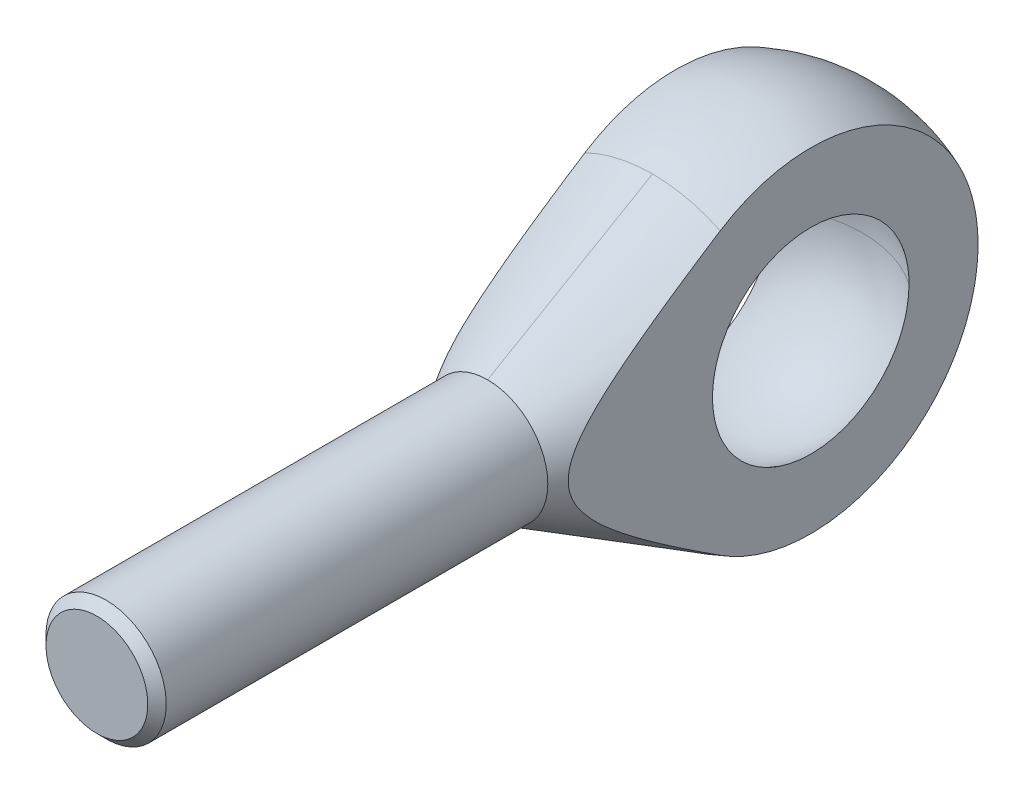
ISO-10303-21;
HEADER;
FILE_DESCRIPTION(('STEP AP214'),'2;1');
FILE_NAME('part.step','',(''),(''),'','','');
FILE_SCHEMA(('AUTOMOTIVE_DESIGN { 1 0 10303 214 1 1 1 1 }'));
ENDSEC;
DATA;
#1=APPLICATION_CONTEXT('core data for automotive mechanical design processes');
#2=APPLICATION_PROTOCOL_DEFINITION('international standard','automotive_design',2000,#1);
#3=PRODUCT_CONTEXT('',#1,'mechanical');
#4=PRODUCT('Part','Part','',(#3));
#5=PRODUCT_RELATED_PRODUCT_CATEGORY('part','',(#4));
#6=PRODUCT_DEFINITION_FORMATION('','',#4);
#7=PRODUCT_DEFINITION_CONTEXT('part definition',#1,'design');
#8=PRODUCT_DEFINITION('design','',#6,#7);
#9=PRODUCT_DEFINITION_SHAPE('','',#8);
#10=(LENGTH_UNIT() NAMED_UNIT(*) SI_UNIT(.MILLI.,.METRE.));
#11=(NAMED_UNIT(*) PLANE_ANGLE_UNIT() SI_UNIT($,.RADIAN.));
#12=(NAMED_UNIT(*) SI_UNIT($,.STERADIAN.) SOLID_ANGLE_UNIT());
#13=UNCERTAINTY_MEASURE_WITH_UNIT(LENGTH_MEASURE(1.E-05),#10,'distance_accuracy_value','');
#14=(GEOMETRIC_REPRESENTATION_CONTEXT(3) GLOBAL_UNCERTAINTY_ASSIGNED_CONTEXT((#13)) GLOBAL_UNIT_ASSIGNED_CONTEXT((#10,
#11,#12)) REPRESENTATION_CONTEXT('',''));
#15=CARTESIAN_POINT('',(0.,0.,0.));
#16=DIRECTION('',(0.,0.,1.));
#17=DIRECTION('',(1.,0.,0.));
#18=AXIS2_PLACEMENT_3D('',#15,#16,#17);
#19=CARTESIAN_POINT('',(0.,0.,0.));
#20=DIRECTION('',(0.,0.,1.));
#21=DIRECTION('',(0.,1.,0.));
#22=AXIS2_PLACEMENT_3D('',#19,#20,#21);
#23=SPHERICAL_SURFACE('',#22,7.935);
#24=CARTESIAN_POINT('',(0.,0.,-7.935));
#25=CARTESIAN_POINT('',(-0.0996818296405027,5.36051834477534E-13,-7.93500095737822));
#26=CARTESIAN_POINT('',(-0.199363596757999,1.00497345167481E-12,-7.93312168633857));
#27=CARTESIAN_POINT('',(-0.398585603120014,1.82083673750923E-12,-7.92560956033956));
#28=CARTESIAN_POINT('',(-0.498125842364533,2.16777840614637E-12,-7.91997670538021));
#29=CARTESIAN_POINT('',(-0.696923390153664,2.75196228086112E-12,-7.90496428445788));
#30=CARTESIAN_POINT('',(-0.796180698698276,2.98920448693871E-12,-7.8955847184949));
#31=CARTESIAN_POINT('',(-0.99427143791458,3.36670066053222E-12,-7.87309249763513));
#32=CARTESIAN_POINT('',(-1.09310486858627,3.50695462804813E-12,-7.85997984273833));
#33=CARTESIAN_POINT('',(-1.29020749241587,3.70303460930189E-12,-7.83003998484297));
#34=CARTESIAN_POINT('',(-1.38847668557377,3.75886062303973E-12,-7.81321278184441));
#35=CARTESIAN_POINT('',(-1.58431127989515,3.79870932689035E-12,-7.7758677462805));
#36=CARTESIAN_POINT('',(-1.68187668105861,3.78273201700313E-12,-7.75534991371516));
#37=CARTESIAN_POINT('',(-1.87616513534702,3.69288207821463E-12,-7.71065275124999));
#38=CARTESIAN_POINT('',(-1.97288818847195,3.61900944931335E-12,-7.68647342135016));
#39=CARTESIAN_POINT('',(-2.16535458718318,3.42533572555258E-12,-7.63448760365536));
#40=CARTESIAN_POINT('',(-2.26109793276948,3.30553463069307E-12,-7.60668111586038));
#41=CARTESIAN_POINT('',(-2.45146894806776,3.0338454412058E-12,-7.54748047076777));
#42=CARTESIAN_POINT('',(-2.54609661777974,2.88195734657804E-12,-7.51608631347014));
#43=CARTESIAN_POINT('',(-2.73410189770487,2.55848568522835E-12,-7.44975491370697));
#44=CARTESIAN_POINT('',(-2.82747950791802,2.38690211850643E-12,-7.41481767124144));
#45=CARTESIAN_POINT('',(-3.01285205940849,2.03688844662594E-12,-7.34144971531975));
#46=CARTESIAN_POINT('',(-3.10484700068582,1.85845834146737E-12,-7.30301900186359));
#47=CARTESIAN_POINT('',(-3.28732357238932,1.50720477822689E-12,-7.22271868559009));
#48=CARTESIAN_POINT('',(-3.37780520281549,1.33438132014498E-12,-7.18084908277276));
#49=CARTESIAN_POINT('',(-3.55712664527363,1.00663690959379E-12,-7.09373042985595));
#50=CARTESIAN_POINT('',(-3.64596645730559,8.51715957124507E-13,-7.04848137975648));
#51=CARTESIAN_POINT('',(-3.82187814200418,5.71472286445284E-13,-6.95466816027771));
#52=CARTESIAN_POINT('',(-3.9089500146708,4.46149568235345E-13,-6.90610399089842));
#53=CARTESIAN_POINT('',(-4.0812020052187,2.37395194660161E-13,-6.80572924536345));
#54=CARTESIAN_POINT('',(-4.16638212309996,1.53963539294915E-13,-6.75391866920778));
#55=CARTESIAN_POINT('',(-4.33473024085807,0.,-6.64712563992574));
#56=CARTESIAN_POINT('',(-4.4178982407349,0.,-6.59214318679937));
#57=CARTESIAN_POINT('',(-4.49999999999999,0.,-6.53561206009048));
#58=B_SPLINE_CURVE_WITH_KNOTS('',3,(#24,#25,#26,#27,#28,#29,#30,#31,#32,#33,#34,#35,#36,#37,#38,
#39,#40,#41,#42,#43,#44,#45,#46,#47,#48,#49,#50,#51,#52,#53,#54,#55,#56,#57),.UNSPECIFIED.,.F.,
.F.,(4,2,2,2,2,2,2,2,2,2,2,2,2,2,2,2,4),(0.,0.299027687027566,0.598055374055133,0.8970830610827,
1.19611074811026,1.49513843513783,1.7941661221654,2.09319380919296,2.39222149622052,
2.69124918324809,2.99027687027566,3.28930455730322,3.58833224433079,3.88735993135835,
4.18638761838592,4.48541530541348,4.78444299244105),.UNSPECIFIED.);
#59=CARTESIAN_POINT('',(0.,0.,-7.935));
#60=VERTEX_POINT('',#59);
#61=CARTESIAN_POINT('',(-4.5,0.,-6.53561206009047));
#62=VERTEX_POINT('',#61);
#63=EDGE_CURVE('E206',#60,#62,#58,.T.);
#64=ORIENTED_EDGE('',*,*,#63,.T.);
#65=CARTESIAN_POINT('',(-4.5,0.,-6.53561206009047));
#66=CARTESIAN_POINT('',(-4.5,-0.183821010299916,-6.53563182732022));
#67=CARTESIAN_POINT('',(-4.5,-0.367639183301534,-6.52785764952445));
#68=CARTESIAN_POINT('',(-4.5,-0.733960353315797,-6.49686417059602));
#69=CARTESIAN_POINT('',(-4.5,-0.916463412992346,-6.47364561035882));
#70=CARTESIAN_POINT('',(-4.5,-1.27872582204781,-6.41192943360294));
#71=CARTESIAN_POINT('',(-4.5,-1.45848714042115,-6.3734433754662));
#72=CARTESIAN_POINT('',(-4.5,-1.81412842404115,-6.2814721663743));
#73=CARTESIAN_POINT('',(-4.5,-1.99000843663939,-6.22798719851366));
#74=CARTESIAN_POINT('',(-4.5,-2.33669238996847,-6.1063778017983));
#75=CARTESIAN_POINT('',(-4.5,-2.50749477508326,-6.03824893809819));
#76=CARTESIAN_POINT('',(-4.5,-2.84281554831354,-5.88781828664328));
#77=CARTESIAN_POINT('',(-4.5,-3.00733159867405,-5.80551128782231));
#78=CARTESIAN_POINT('',(-4.5,-3.3287832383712,-5.62736012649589));
#79=CARTESIAN_POINT('',(-4.5,-3.48572161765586,-5.53152099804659));
#80=CARTESIAN_POINT('',(-4.5,-3.79097095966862,-5.32696163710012));
#81=CARTESIAN_POINT('',(-4.5,-3.93928173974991,-5.21824113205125));
#82=CARTESIAN_POINT('',(-4.5,-4.22621506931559,-4.98869581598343));
#83=CARTESIAN_POINT('',(-4.5,-4.36483781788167,-4.86787125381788));
#84=CARTESIAN_POINT('',(-4.5,-4.63141315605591,-4.61497475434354));
#85=CARTESIAN_POINT('',(-4.5,-4.75936574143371,-4.48290281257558));
#86=CARTESIAN_POINT('',(-4.5,-5.00371640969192,-4.20842199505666));
#87=CARTESIAN_POINT('',(-4.5,-5.12011210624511,-4.06601099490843));
#88=CARTESIAN_POINT('',(-4.5,-5.34048903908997,-3.77189202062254));
#89=CARTESIAN_POINT('',(-4.5,-5.44447053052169,-3.62018423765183));
#90=CARTESIAN_POINT('',(-4.5,-5.63932036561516,-3.30848658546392));
#91=CARTESIAN_POINT('',(-4.5,-5.73018360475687,-3.14849352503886));
#92=CARTESIAN_POINT('',(-4.5,-5.89807153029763,-2.82147988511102));
#93=CARTESIAN_POINT('',(-4.5,-5.97510123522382,-2.65446188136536));
#94=CARTESIAN_POINT('',(-4.5,-6.11479568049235,-2.31457148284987));
#95=CARTESIAN_POINT('',(-4.5,-6.17746451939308,-2.14170077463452));
#96=CARTESIAN_POINT('',(-4.5,-6.28800408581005,-1.79136322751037));
#97=CARTESIAN_POINT('',(-4.5,-6.33587837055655,-1.61389750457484));
#98=CARTESIAN_POINT('',(-4.5,-6.42914858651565,-1.19933290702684));
#99=CARTESIAN_POINT('',(-4.5,-6.46907106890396,-0.960966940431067));
#100=CARTESIAN_POINT('',(-4.5,-6.50899100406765,-0.601503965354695));
#101=CARTESIAN_POINT('',(-4.5,-6.518970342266,-0.481424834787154));
#102=CARTESIAN_POINT('',(-4.5,-6.53228004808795,-0.240906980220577));
#103=CARTESIAN_POINT('',(-4.5,-6.53561087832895,-0.120468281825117));
#104=CARTESIAN_POINT('',(-4.5,-6.53561206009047,0.));
#105=B_SPLINE_CURVE_WITH_KNOTS('',3,(#65,#66,#67,#68,#69,#70,#71,#72,#73,#74,#75,#76,#77,#78,
#79,#80,#81,#82,#83,#84,#85,#86,#87,#88,#89,#90,#91,#92,#93,#94,#95,#96,#97,#98,#99,#100,#101,
#102,#103,#104),.UNSPECIFIED.,.F.,.F.,(4,2,2,2,2,2,2,2,2,2,2,2,2,2,2,2,2,2,2,4),(0.,
0.55129471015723,1.10256297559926,1.65341469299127,2.20425968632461,2.75527173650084,
3.30648674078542,3.85749722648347,4.40851937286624,4.95953019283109,5.51054123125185,
6.06166580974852,6.61277905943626,7.16410618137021,7.71523288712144,8.26620210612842,
8.81703874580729,9.54041501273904,9.90173992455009,10.2630396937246),.UNSPECIFIED.);
#106=CARTESIAN_POINT('',(-4.5,-6.53561206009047,0.));
#107=VERTEX_POINT('',#106);
#108=EDGE_CURVE('E288',#62,#107,#105,.T.);
#109=ORIENTED_EDGE('',*,*,#108,.T.);
#110=CARTESIAN_POINT('',(-4.5,-6.53561206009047,0.));
#111=CARTESIAN_POINT('',(-4.5,-6.53563182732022,0.183821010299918));
#112=CARTESIAN_POINT('',(-4.5,-6.52785764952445,0.367639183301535));
#113=CARTESIAN_POINT('',(-4.5,-6.49686417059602,0.733960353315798));
#114=CARTESIAN_POINT('',(-4.5,-6.47364561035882,0.916463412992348));
#115=CARTESIAN_POINT('',(-4.5,-6.41192943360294,1.27872582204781));
#116=CARTESIAN_POINT('',(-4.5,-6.3734433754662,1.45848714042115));
#117=CARTESIAN_POINT('',(-4.5,-6.2814721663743,1.81412842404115));
#118=CARTESIAN_POINT('',(-4.5,-6.22798719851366,1.99000843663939));
#119=CARTESIAN_POINT('',(-4.5,-6.1063778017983,2.33669238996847));
#120=CARTESIAN_POINT('',(-4.5,-6.03824893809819,2.50749477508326));
#121=CARTESIAN_POINT('',(-4.5,-5.88781828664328,2.84281554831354));
#122=CARTESIAN_POINT('',(-4.5,-5.80551128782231,3.00733159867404));
#123=CARTESIAN_POINT('',(-4.5,-5.62736012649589,3.3287832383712));
#124=CARTESIAN_POINT('',(-4.5,-5.53152099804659,3.48572161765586));
#125=CARTESIAN_POINT('',(-4.5,-5.32696163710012,3.79097095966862));
#126=CARTESIAN_POINT('',(-4.5,-5.21824113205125,3.93928173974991));
#127=CARTESIAN_POINT('',(-4.5,-4.98869581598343,4.22621506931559));
#128=CARTESIAN_POINT('',(-4.5,-4.86787125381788,4.36483781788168));
#129=CARTESIAN_POINT('',(-4.5,-4.61497475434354,4.63141315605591));
#130=CARTESIAN_POINT('',(-4.5,-4.48290281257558,4.75936574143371));
#131=CARTESIAN_POINT('',(-4.5,-4.20842199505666,5.00371640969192));
#132=CARTESIAN_POINT('',(-4.5,-4.06601099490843,5.12011210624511));
#133=CARTESIAN_POINT('',(-4.5,-3.77189202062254,5.34048903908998));
#134=CARTESIAN_POINT('',(-4.5,-3.62018423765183,5.44447053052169));
#135=CARTESIAN_POINT('',(-4.5,-3.30848658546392,5.63932036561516));
#136=CARTESIAN_POINT('',(-4.5,-3.14849352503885,5.73018360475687));
#137=CARTESIAN_POINT('',(-4.5,-2.82147988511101,5.89807153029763));
#138=CARTESIAN_POINT('',(-4.5,-2.65446188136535,5.97510123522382));
#139=CARTESIAN_POINT('',(-4.5,-2.31457148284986,6.11479568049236));
#140=CARTESIAN_POINT('',(-4.5,-2.14170077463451,6.17746451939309));
#141=CARTESIAN_POINT('',(-4.5,-1.79136322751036,6.28800408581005));
#142=CARTESIAN_POINT('',(-4.5,-1.61389750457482,6.33587837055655));
#143=CARTESIAN_POINT('',(-4.5,-1.19933290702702,6.4291485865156));
#144=CARTESIAN_POINT('',(-4.5,-0.960966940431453,6.46907106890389));
#145=CARTESIAN_POINT('',(-4.5,-0.601503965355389,6.50899100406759));
#146=CARTESIAN_POINT('',(-4.5,-0.481424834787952,6.51897034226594));
#147=CARTESIAN_POINT('',(-4.5,-0.240906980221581,6.53228004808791));
#148=CARTESIAN_POINT('',(-4.5,-0.120468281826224,6.53561087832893));
#149=CARTESIAN_POINT('',(-4.5,-1.21083698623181E-12,6.53561206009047));
#150=B_SPLINE_CURVE_WITH_KNOTS('',3,(#110,#111,#112,#113,#114,#115,#116,#117,#118,#119,#120,
#121,#122,#123,#124,#125,#126,#127,#128,#129,#130,#131,#132,#133,#134,#135,#136,#137,#138,#139,
#140,#141,#142,#143,#144,#145,#146,#147,#148,#149),.UNSPECIFIED.,.F.,.F.,(4,2,2,2,2,2,2,2,2,2,2,
2,2,2,2,2,2,2,2,4),(0.,0.551294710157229,1.10256297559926,1.65341469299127,2.20425968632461,
2.75527173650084,3.30648674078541,3.85749722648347,4.40851937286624,4.95953019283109,
5.51054123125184,6.06166580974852,6.61277905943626,7.16410618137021,7.71523288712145,
8.26620210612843,8.81703874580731,9.54041501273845,9.90173992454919,10.2630396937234),.UNSPECIFIED.);
#151=CARTESIAN_POINT('',(-4.5,-4.2344436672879E-12,6.53561206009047));
#152=VERTEX_POINT('',#151);
#153=EDGE_CURVE('E320',#107,#152,#150,.T.);
#154=ORIENTED_EDGE('',*,*,#153,.T.);
#155=CARTESIAN_POINT('',(0.,0.,0.));
#156=DIRECTION('',(1.61309282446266E-12,-1.,0.));
#157=DIRECTION('',(0.,0.,1.));
#158=AXIS2_PLACEMENT_3D('',#155,#156,#157);
#159=CIRCLE('',#158,7.935);
#160=CARTESIAN_POINT('',(0.,0.,7.935));
#161=VERTEX_POINT('',#160);
#162=EDGE_CURVE('E336',#152,#161,#159,.F.);
#163=ORIENTED_EDGE('',*,*,#162,.T.);
#164=CARTESIAN_POINT('',(0.,0.,7.935));
#165=CARTESIAN_POINT('',(0.0996818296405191,-5.36202630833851E-13,7.93500095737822));
#166=CARTESIAN_POINT('',(0.199363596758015,-1.00550982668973E-12,7.93312168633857));
#167=CARTESIAN_POINT('',(0.39858560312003,-1.8220996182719E-12,7.92560956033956));
#168=CARTESIAN_POINT('',(0.498125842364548,-2.1693822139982E-12,7.91997670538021));
#169=CARTESIAN_POINT('',(0.696923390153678,-2.75368907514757E-12,7.90496428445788));
#170=CARTESIAN_POINT('',(0.79618069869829,-2.99071334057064E-12,7.8955847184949));
#171=CARTESIAN_POINT('',(0.994271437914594,-3.36739887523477E-12,7.87309249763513));
#172=CARTESIAN_POINT('',(1.09310486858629,-3.50706014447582E-12,7.85997984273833));
#173=CARTESIAN_POINT('',(1.29020749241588,-3.70322096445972E-12,7.83003998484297));
#174=CARTESIAN_POINT('',(1.38847668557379,-3.75972051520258E-12,7.81321278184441));
#175=CARTESIAN_POINT('',(1.58431127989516,-3.80019377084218E-12,7.7758677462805));
#176=CARTESIAN_POINT('',(1.68187668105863,-3.78416747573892E-12,7.75534991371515));
#177=CARTESIAN_POINT('',(1.87616513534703,-3.69346244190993E-12,7.71065275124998));
#178=CARTESIAN_POINT('',(1.97288818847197,-3.61878370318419E-12,7.68647342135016));
#179=CARTESIAN_POINT('',(2.1653545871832,-3.42423051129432E-12,7.63448760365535));
#180=CARTESIAN_POINT('',(2.26109793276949,-3.30435605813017E-12,7.60668111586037));
#181=CARTESIAN_POINT('',(2.45146894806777,-3.03350833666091E-12,7.54748047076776));
#182=CARTESIAN_POINT('',(2.54609661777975,-2.88253506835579E-12,7.51608631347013));
#183=CARTESIAN_POINT('',(2.73410189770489,-2.55855460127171E-12,7.44975491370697));
#184=CARTESIAN_POINT('',(2.82747950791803,-2.38554740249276E-12,7.41481767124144));
#185=CARTESIAN_POINT('',(3.0128520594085,-2.03506795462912E-12,7.34144971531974));
#186=CARTESIAN_POINT('',(3.10484700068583,-1.85759570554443E-12,7.30301900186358));
#187=CARTESIAN_POINT('',(3.28732357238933,-1.5045921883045E-12,7.22271868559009));
#188=CARTESIAN_POINT('',(3.3778052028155,-1.32906092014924E-12,7.18084908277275));
#189=CARTESIAN_POINT('',(3.55712664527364,-1.00048768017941E-12,7.09373042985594));
#190=CARTESIAN_POINT('',(3.6459664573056,-8.47445708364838E-13,7.04848137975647));
#191=CARTESIAN_POINT('',(3.82187814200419,-5.66707914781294E-13,6.95466816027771));
#192=CARTESIAN_POINT('',(3.90895001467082,-4.39012093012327E-13,6.90610399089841));
#193=CARTESIAN_POINT('',(4.08120200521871,-2.29543649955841E-13,6.80572924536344));
#194=CARTESIAN_POINT('',(4.16638212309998,-1.47771028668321E-13,6.75391866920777));
#195=CARTESIAN_POINT('',(4.33473024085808,0.,6.64712563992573));
#196=CARTESIAN_POINT('',(4.41789824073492,0.,6.59214318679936));
#197=CARTESIAN_POINT('',(4.5,0.,6.53561206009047));
#198=B_SPLINE_CURVE_WITH_KNOTS('',3,(#164,#165,#166,#167,#168,#169,#170,#171,#172,#173,#174,
#175,#176,#177,#178,#179,#180,#181,#182,#183,#184,#185,#186,#187,#188,#189,#190,#191,#192,#193,
#194,#195,#196,#197),.UNSPECIFIED.,.F.,.F.,(4,2,2,2,2,2,2,2,2,2,2,2,2,2,2,2,4),(0.,
0.299027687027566,0.598055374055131,0.897083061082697,1.19611074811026,1.49513843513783,
1.79416612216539,2.09319380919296,2.39222149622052,2.69124918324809,2.99027687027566,
3.28930455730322,3.58833224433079,3.88735993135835,4.18638761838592,4.48541530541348,
4.78444299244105),.UNSPECIFIED.);
#199=CARTESIAN_POINT('',(4.5,-1.21025874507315E-12,6.53561206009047));
#200=VERTEX_POINT('',#199);
#201=EDGE_CURVE('E194',#161,#200,#198,.T.);
#202=ORIENTED_EDGE('',*,*,#201,.T.);
#203=CARTESIAN_POINT('',(4.5,-1.2117043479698E-12,6.53561206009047));
#204=CARTESIAN_POINT('',(4.5,-0.183816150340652,6.53563182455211));
#205=CARTESIAN_POINT('',(4.5,-0.367629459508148,6.52785805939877));
#206=CARTESIAN_POINT('',(4.5,-0.73394102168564,6.49686621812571));
#207=CARTESIAN_POINT('',(4.5,-0.916439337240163,6.47364888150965));
#208=CARTESIAN_POINT('',(4.5,-1.27870202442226,6.41193431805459));
#209=CARTESIAN_POINT('',(4.5,-1.45846822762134,6.37344784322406));
#210=CARTESIAN_POINT('',(4.5,-1.81411911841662,6.28147499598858));
#211=CARTESIAN_POINT('',(4.5,-1.99000385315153,6.22798880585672));
#212=CARTESIAN_POINT('',(4.5,-2.33669405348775,6.10637721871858));
#213=CARTESIAN_POINT('',(4.5,-2.5074980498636,6.03824763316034));
#214=CARTESIAN_POINT('',(4.5,-2.84282211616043,5.88781517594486));
#215=CARTESIAN_POINT('',(4.5,-3.00733984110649,5.8055070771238));
#216=CARTESIAN_POINT('',(4.5,-3.32876329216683,5.62737082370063));
#217=CARTESIAN_POINT('',(4.5,-3.48567327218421,5.53155034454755));
#218=CARTESIAN_POINT('',(4.5,-3.7909223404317,5.32699726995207));
#219=CARTESIAN_POINT('',(4.5,-3.9392582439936,5.21825992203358));
#220=CARTESIAN_POINT('',(4.5,-4.22619172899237,4.98871449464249));
#221=CARTESIAN_POINT('',(4.5,-4.36479267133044,4.86791061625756));
#222=CARTESIAN_POINT('',(4.5,-4.63137726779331,4.61501226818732));
#223=CARTESIAN_POINT('',(4.5,-4.759356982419,4.48291364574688));
#224=CARTESIAN_POINT('',(4.5,-5.00370536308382,4.20843340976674));
#225=CARTESIAN_POINT('',(4.5,-5.12007653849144,4.06605403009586));
#226=CARTESIAN_POINT('',(4.5,-5.34045298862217,3.77194456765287));
#227=CARTESIAN_POINT('',(4.5,-5.44445368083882,3.62021105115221));
#228=CARTESIAN_POINT('',(4.5,-5.63925915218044,3.30858464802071));
#229=CARTESIAN_POINT('',(4.5,-5.73006936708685,3.14869515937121));
#230=CARTESIAN_POINT('',(4.5,-5.89793070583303,2.82177503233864));
#231=CARTESIAN_POINT('',(4.5,-5.97497673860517,2.6547417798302));
#232=CARTESIAN_POINT('',(4.5,-6.11469024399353,2.31485098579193));
#233=CARTESIAN_POINT('',(4.5,-6.17736392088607,2.14199599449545));
#234=CARTESIAN_POINT('',(4.5,-6.28795039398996,1.79155698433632));
#235=CARTESIAN_POINT('',(4.5,-6.33585774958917,1.61397124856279));
#236=CARTESIAN_POINT('',(4.5,-6.41653258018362,1.25542605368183));
#237=CARTESIAN_POINT('',(4.5,-6.44930268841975,1.07446718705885));
#238=CARTESIAN_POINT('',(4.5,-6.49948290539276,0.710428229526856));
#239=CARTESIAN_POINT('',(4.5,-6.51689268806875,0.527348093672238));
#240=CARTESIAN_POINT('',(4.5,-6.53622740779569,0.160369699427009));
#241=CARTESIAN_POINT('',(4.5,-6.53815215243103,-0.023528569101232));
#242=CARTESIAN_POINT('',(4.5,-6.52650260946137,-0.390833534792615));
#243=CARTESIAN_POINT('',(4.5,-6.51292832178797,-0.574240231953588));
#244=CARTESIAN_POINT('',(4.5,-6.47037720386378,-0.939258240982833));
#245=CARTESIAN_POINT('',(4.5,-6.44140036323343,-1.12086955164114));
#246=CARTESIAN_POINT('',(4.5,-6.36825093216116,-1.48100163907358));
#247=CARTESIAN_POINT('',(4.5,-6.3240786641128,-1.6595224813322));
#248=CARTESIAN_POINT('',(4.5,-6.22084236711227,-2.01224226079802));
#249=CARTESIAN_POINT('',(4.5,-6.16177548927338,-2.18644036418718));
#250=CARTESIAN_POINT('',(4.5,-6.02919869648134,-2.52917713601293));
#251=CARTESIAN_POINT('',(4.5,-5.95569410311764,-2.69771786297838));
#252=CARTESIAN_POINT('',(4.5,-5.79471863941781,-3.02807469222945));
#253=CARTESIAN_POINT('',(4.5,-5.70724226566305,-3.18988811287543));
#254=CARTESIAN_POINT('',(4.5,-5.51900102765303,-3.50551042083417));
#255=CARTESIAN_POINT('',(4.5,-5.41824107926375,-3.65932224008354));
#256=CARTESIAN_POINT('',(4.5,-5.20408953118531,-3.95796024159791));
#257=CARTESIAN_POINT('',(4.5,-5.09069390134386,-4.10278353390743));
#258=CARTESIAN_POINT('',(4.5,-4.85214777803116,-4.38230923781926));
#259=CARTESIAN_POINT('',(4.5,-4.72700163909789,-4.51701536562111));
#260=CARTESIAN_POINT('',(4.5,-4.4657777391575,-4.77543895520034));
#261=CARTESIAN_POINT('',(4.5,-4.32969742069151,-4.8991538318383));
#262=CARTESIAN_POINT('',(4.5,-4.04765038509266,-5.13463626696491));
#263=CARTESIAN_POINT('',(4.5,-3.90168733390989,-5.24640821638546));
#264=CARTESIAN_POINT('',(4.5,-3.60076345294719,-5.45733562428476));
#265=CARTESIAN_POINT('',(4.5,-3.44579650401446,-5.55648235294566));
#266=CARTESIAN_POINT('',(4.5,-3.12811732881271,-5.74132968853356));
#267=CARTESIAN_POINT('',(4.5,-2.96540798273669,-5.82703524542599));
#268=CARTESIAN_POINT('',(4.5,-2.6331849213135,-5.98451238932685));
#269=CARTESIAN_POINT('',(4.5,-2.46366468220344,-6.05627021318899));
#270=CARTESIAN_POINT('',(4.5,-2.11924070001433,-6.18521165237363));
#271=CARTESIAN_POINT('',(4.5,-1.94433900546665,-6.24240073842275));
#272=CARTESIAN_POINT('',(4.5,-1.5905374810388,-6.34177775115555));
#273=CARTESIAN_POINT('',(4.5,-1.4116422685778,-6.38398213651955));
#274=CARTESIAN_POINT('',(4.5,-1.05100443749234,-6.45316206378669));
#275=CARTESIAN_POINT('',(4.5,-0.869263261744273,-6.48014508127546));
#276=CARTESIAN_POINT('',(4.5,-0.572605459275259,-6.51149200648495));
#277=CARTESIAN_POINT('',(4.5,-0.458163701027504,-6.52054279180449));
#278=CARTESIAN_POINT('',(4.5,-0.229151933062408,-6.5325984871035));
#279=CARTESIAN_POINT('',(4.5,-0.114582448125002,-6.53561336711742));
#280=CARTESIAN_POINT('',(4.5,0.,-6.53561206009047));
#281=B_SPLINE_CURVE_WITH_KNOTS('',3,(#203,#204,#205,#206,#207,#208,#209,#210,#211,#212,#213,
#214,#215,#216,#217,#218,#219,#220,#221,#222,#223,#224,#225,#226,#227,#228,#229,#230,#231,#232,
#233,#234,#235,#236,#237,#238,#239,#240,#241,#242,#243,#244,#245,#246,#247,#248,#249,#250,#251,
#252,#253,#254,#255,#256,#257,#258,#259,#260,#261,#262,#263,#264,#265,#266,#267,#268,#269,#270,
#271,#272,#273,#274,#275,#276,#277,#278,#279,#280),.UNSPECIFIED.,.F.,.F.,(4,2,2,2,2,2,2,2,2,2,2,
2,2,2,2,2,2,2,2,2,2,2,2,2,2,2,2,2,2,2,2,2,2,2,2,2,2,2,4),(0.,0.551280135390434,1.10253387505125,
1.65340012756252,2.20425968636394,2.7552770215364,3.30649793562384,3.85740699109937,
4.40851937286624,4.95944054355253,5.51056515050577,6.06157036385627,6.61277905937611,
7.16375995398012,7.71494422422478,8.26589010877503,8.81703874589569,9.36809147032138,
9.91915589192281,10.4702271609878,11.0212984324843,11.5723700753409,12.1234300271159,
12.6745954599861,13.2255581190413,13.7767383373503,14.327715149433,14.878868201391,
15.4298178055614,15.9808966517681,16.5317721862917,17.0830265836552,17.634077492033,
18.1856694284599,18.7370539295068,19.2878309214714,19.8383371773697,20.1825881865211,
20.5262700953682),.UNSPECIFIED.);
#282=CARTESIAN_POINT('',(4.5,0.,-6.53561206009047));
#283=VERTEX_POINT('',#282);
#284=EDGE_CURVE('E172',#200,#283,#281,.T.);
#285=ORIENTED_EDGE('',*,*,#284,.T.);
#286=CARTESIAN_POINT('',(0.,0.,0.));
#287=DIRECTION('',(0.,1.,0.));
#288=DIRECTION('',(0.,0.,1.));
#289=AXIS2_PLACEMENT_3D('',#286,#287,#288);
#290=CIRCLE('',#289,7.935);
#291=EDGE_CURVE('E332',#283,#60,#290,.T.);
#292=ORIENTED_EDGE('',*,*,#291,.T.);
#293=EDGE_LOOP('',(#64,#109,#154,#163,#202,#285,#292));
#294=FACE_BOUND('',#293,.T.);
#295=ADVANCED_FACE('F14',(#294),#23,.F.);
#296=CARTESIAN_POINT('',(0.,0.,0.));
#297=DIRECTION('',(0.,0.,1.));
#298=DIRECTION('',(0.,1.,0.));
#299=AXIS2_PLACEMENT_3D('',#296,#297,#298);
#300=SPHERICAL_SURFACE('',#299,7.935);
#301=ORIENTED_EDGE('',*,*,#291,.F.);
#302=CARTESIAN_POINT('',(4.5,0.,-6.53561206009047));
#303=CARTESIAN_POINT('',(4.5,0.183821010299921,-6.53563182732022));
#304=CARTESIAN_POINT('',(4.5,0.367639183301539,-6.52785764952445));
#305=CARTESIAN_POINT('',(4.5,0.733960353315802,-6.49686417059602));
#306=CARTESIAN_POINT('',(4.5,0.916463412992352,-6.47364561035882));
#307=CARTESIAN_POINT('',(4.5,1.27872582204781,-6.41192943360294));
#308=CARTESIAN_POINT('',(4.5,1.45848714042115,-6.3734433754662));
#309=CARTESIAN_POINT('',(4.5,1.81412842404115,-6.2814721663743));
#310=CARTESIAN_POINT('',(4.5,1.99000843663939,-6.22798719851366));
#311=CARTESIAN_POINT('',(4.5,2.33669238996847,-6.1063778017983));
#312=CARTESIAN_POINT('',(4.5,2.50749477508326,-6.03824893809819));
#313=CARTESIAN_POINT('',(4.5,2.84281554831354,-5.88781828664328));
#314=CARTESIAN_POINT('',(4.5,3.00733159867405,-5.80551128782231));
#315=CARTESIAN_POINT('',(4.5,3.3287832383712,-5.62736012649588));
#316=CARTESIAN_POINT('',(4.5,3.48572161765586,-5.53152099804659));
#317=CARTESIAN_POINT('',(4.5,3.79097095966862,-5.32696163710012));
#318=CARTESIAN_POINT('',(4.5,3.93928173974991,-5.21824113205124));
#319=CARTESIAN_POINT('',(4.5,4.22621506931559,-4.98869581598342));
#320=CARTESIAN_POINT('',(4.5,4.36483781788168,-4.86787125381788));
#321=CARTESIAN_POINT('',(4.5,4.63141315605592,-4.61497475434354));
#322=CARTESIAN_POINT('',(4.5,4.75936574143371,-4.48290281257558));
#323=CARTESIAN_POINT('',(4.5,5.00371640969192,-4.20842199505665));
#324=CARTESIAN_POINT('',(4.5,5.12011210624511,-4.06601099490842));
#325=CARTESIAN_POINT('',(4.5,5.34048903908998,-3.77189202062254));
#326=CARTESIAN_POINT('',(4.5,5.44447053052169,-3.62018423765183));
#327=CARTESIAN_POINT('',(4.5,5.63932036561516,-3.30848658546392));
#328=CARTESIAN_POINT('',(4.5,5.73018360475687,-3.14849352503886));
#329=CARTESIAN_POINT('',(4.5,5.89807153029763,-2.82147988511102));
#330=CARTESIAN_POINT('',(4.5,5.97510123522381,-2.65446188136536));
#331=CARTESIAN_POINT('',(4.5,6.11479568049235,-2.31457148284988));
#332=CARTESIAN_POINT('',(4.5,6.17746451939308,-2.14170077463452));
#333=CARTESIAN_POINT('',(4.5,6.28800408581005,-1.79136322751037));
#334=CARTESIAN_POINT('',(4.5,6.33587837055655,-1.61389750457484));
#335=CARTESIAN_POINT('',(4.5,6.42914858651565,-1.19933290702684));
#336=CARTESIAN_POINT('',(4.5,6.46907106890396,-0.960966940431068));
#337=CARTESIAN_POINT('',(4.5,6.50899100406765,-0.601503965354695));
#338=CARTESIAN_POINT('',(4.5,6.518970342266,-0.481424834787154));
#339=CARTESIAN_POINT('',(4.5,6.53228004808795,-0.240906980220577));
#340=CARTESIAN_POINT('',(4.5,6.53561087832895,-0.120468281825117));
#341=CARTESIAN_POINT('',(4.5,6.53561206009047,0.));
#342=B_SPLINE_CURVE_WITH_KNOTS('',3,(#302,#303,#304,#305,#306,#307,#308,#309,#310,#311,#312,
#313,#314,#315,#316,#317,#318,#319,#320,#321,#322,#323,#324,#325,#326,#327,#328,#329,#330,#331,
#332,#333,#334,#335,#336,#337,#338,#339,#340,#341),.UNSPECIFIED.,.F.,.F.,(4,2,2,2,2,2,2,2,2,2,2,
2,2,2,2,2,2,2,2,4),(0.,0.551294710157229,1.10256297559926,1.65341469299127,2.2042596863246,
2.75527173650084,3.30648674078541,3.85749722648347,4.40851937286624,4.95953019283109,
5.51054123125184,6.06166580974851,6.61277905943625,7.1641061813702,7.71523288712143,
8.26620210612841,8.81703874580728,9.54041501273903,9.90173992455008,10.2630396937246),.UNSPECIFIED.);
#343=CARTESIAN_POINT('',(4.5,6.53561206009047,0.));
#344=VERTEX_POINT('',#343);
#345=EDGE_CURVE('E164',#283,#344,#342,.T.);
#346=ORIENTED_EDGE('',*,*,#345,.T.);
#347=CARTESIAN_POINT('',(4.5,6.53561206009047,0.));
#348=CARTESIAN_POINT('',(4.5,6.53563182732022,0.183821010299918));
#349=CARTESIAN_POINT('',(4.5,6.52785764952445,0.367639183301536));
#350=CARTESIAN_POINT('',(4.5,6.49686417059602,0.733960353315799));
#351=CARTESIAN_POINT('',(4.5,6.47364561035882,0.916463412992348));
#352=CARTESIAN_POINT('',(4.5,6.41192943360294,1.27872582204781));
#353=CARTESIAN_POINT('',(4.5,6.3734433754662,1.45848714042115));
#354=CARTESIAN_POINT('',(4.5,6.2814721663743,1.81412842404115));
#355=CARTESIAN_POINT('',(4.5,6.22798719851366,1.99000843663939));
#356=CARTESIAN_POINT('',(4.5,6.1063778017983,2.33669238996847));
#357=CARTESIAN_POINT('',(4.5,6.03824893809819,2.50749477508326));
#358=CARTESIAN_POINT('',(4.5,5.88781828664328,2.84281554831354));
#359=CARTESIAN_POINT('',(4.5,5.80551128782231,3.00733159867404));
#360=CARTESIAN_POINT('',(4.5,5.62736012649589,3.3287832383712));
#361=CARTESIAN_POINT('',(4.5,5.53152099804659,3.48572161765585));
#362=CARTESIAN_POINT('',(4.5,5.32696163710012,3.79097095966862));
#363=CARTESIAN_POINT('',(4.5,5.21824113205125,3.9392817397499));
#364=CARTESIAN_POINT('',(4.5,4.98869581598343,4.22621506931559));
#365=CARTESIAN_POINT('',(4.5,4.86787125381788,4.36483781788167));
#366=CARTESIAN_POINT('',(4.5,4.61497475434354,4.63141315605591));
#367=CARTESIAN_POINT('',(4.5,4.48290281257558,4.75936574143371));
#368=CARTESIAN_POINT('',(4.5,4.20842199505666,5.00371640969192));
#369=CARTESIAN_POINT('',(4.5,4.06601099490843,5.12011210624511));
#370=CARTESIAN_POINT('',(4.5,3.77189202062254,5.34048903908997));
#371=CARTESIAN_POINT('',(4.5,3.62018423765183,5.44447053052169));
#372=CARTESIAN_POINT('',(4.5,3.30848658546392,5.63932036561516));
#373=CARTESIAN_POINT('',(4.5,3.14849352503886,5.73018360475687));
#374=CARTESIAN_POINT('',(4.5,2.82147988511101,5.89807153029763));
#375=CARTESIAN_POINT('',(4.5,2.65446188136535,5.97510123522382));
#376=CARTESIAN_POINT('',(4.5,2.31457148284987,6.11479568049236));
#377=CARTESIAN_POINT('',(4.5,2.14170077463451,6.17746451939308));
#378=CARTESIAN_POINT('',(4.5,1.79136322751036,6.28800408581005));
#379=CARTESIAN_POINT('',(4.5,1.61389750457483,6.33587837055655));
#380=CARTESIAN_POINT('',(4.5,1.19933290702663,6.42914858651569));
#381=CARTESIAN_POINT('',(4.5,0.960966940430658,6.46907106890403));
#382=CARTESIAN_POINT('',(4.5,0.601503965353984,6.50899100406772));
#383=CARTESIAN_POINT('',(4.5,0.481424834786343,6.51897034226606));
#384=CARTESIAN_POINT('',(4.5,0.240906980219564,6.53228004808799));
#385=CARTESIAN_POINT('',(4.5,0.120468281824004,6.53561087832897));
#386=CARTESIAN_POINT('',(4.5,-1.2117043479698E-12,6.53561206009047));
#387=B_SPLINE_CURVE_WITH_KNOTS('',3,(#347,#348,#349,#350,#351,#352,#353,#354,#355,#356,#357,
#358,#359,#360,#361,#362,#363,#364,#365,#366,#367,#368,#369,#370,#371,#372,#373,#374,#375,#376,
#377,#378,#379,#380,#381,#382,#383,#384,#385,#386),.UNSPECIFIED.,.F.,.F.,(4,2,2,2,2,2,2,2,2,2,2,
2,2,2,2,2,2,2,2,4),(0.,0.55129471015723,1.10256297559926,1.65341469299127,2.2042596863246,
2.75527173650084,3.30648674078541,3.85749722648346,4.40851937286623,4.95953019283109,
5.51054123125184,6.06166580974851,6.61277905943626,7.16410618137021,7.71523288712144,
8.26620210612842,8.81703874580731,9.54041501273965,9.901739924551,10.2630396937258),.UNSPECIFIED.);
#388=EDGE_CURVE('E286',#344,#200,#387,.T.);
#389=ORIENTED_EDGE('',*,*,#388,.T.);
#390=ORIENTED_EDGE('',*,*,#201,.F.);
#391=ORIENTED_EDGE('',*,*,#162,.F.);
#392=CARTESIAN_POINT('',(-4.5,-1.20996962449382E-12,6.53561206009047));
#393=CARTESIAN_POINT('',(-4.5,0.18381615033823,6.53563182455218));
#394=CARTESIAN_POINT('',(-4.5,0.367629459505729,6.52785805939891));
#395=CARTESIAN_POINT('',(-4.5,0.733941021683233,6.49686621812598));
#396=CARTESIAN_POINT('',(-4.5,0.916439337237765,6.47364888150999));
#397=CARTESIAN_POINT('',(-4.5,1.27870202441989,6.41193431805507));
#398=CARTESIAN_POINT('',(-4.5,1.45846822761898,6.3734478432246));
#399=CARTESIAN_POINT('',(-4.5,1.8141191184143,6.28147499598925));
#400=CARTESIAN_POINT('',(-4.5,1.99000385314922,6.22798880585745));
#401=CARTESIAN_POINT('',(-4.5,2.33669405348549,6.10637721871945));
#402=CARTESIAN_POINT('',(-4.5,2.50749804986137,6.03824763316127));
#403=CARTESIAN_POINT('',(-4.5,2.84282211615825,5.88781517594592));
#404=CARTESIAN_POINT('',(-4.5,3.00733984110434,5.80550707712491));
#405=CARTESIAN_POINT('',(-4.5,3.32876329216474,5.62737082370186));
#406=CARTESIAN_POINT('',(-4.5,3.48567327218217,5.53155034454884));
#407=CARTESIAN_POINT('',(-4.5,3.79092234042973,5.32699726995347));
#408=CARTESIAN_POINT('',(-4.5,3.93925824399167,5.21825992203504));
#409=CARTESIAN_POINT('',(-4.5,4.22619172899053,4.98871449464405));
#410=CARTESIAN_POINT('',(-4.5,4.36479267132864,4.86791061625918));
#411=CARTESIAN_POINT('',(-4.5,4.6313772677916,4.61501226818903));
#412=CARTESIAN_POINT('',(-4.5,4.75935698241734,4.48291364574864));
#413=CARTESIAN_POINT('',(-4.5,5.00370536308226,4.20843340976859));
#414=CARTESIAN_POINT('',(-4.5,5.12007653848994,4.06605403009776));
#415=CARTESIAN_POINT('',(-4.5,5.34045298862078,3.77194456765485));
#416=CARTESIAN_POINT('',(-4.5,5.44445368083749,3.62021105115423));
#417=CARTESIAN_POINT('',(-4.5,5.63925915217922,3.3085846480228));
#418=CARTESIAN_POINT('',(-4.5,5.73006936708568,3.14869515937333));
#419=CARTESIAN_POINT('',(-4.5,5.89793070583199,2.82177503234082));
#420=CARTESIAN_POINT('',(-4.5,5.97497673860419,2.65474177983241));
#421=CARTESIAN_POINT('',(-4.5,6.11469024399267,2.31485098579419));
#422=CARTESIAN_POINT('',(-4.5,6.17736392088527,2.14199599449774));
#423=CARTESIAN_POINT('',(-4.5,6.2879503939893,1.79155698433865));
#424=CARTESIAN_POINT('',(-4.5,6.33585774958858,1.61397124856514));
#425=CARTESIAN_POINT('',(-4.5,6.41653258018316,1.25542605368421));
#426=CARTESIAN_POINT('',(-4.5,6.44930268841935,1.07446718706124));
#427=CARTESIAN_POINT('',(-4.5,6.4994829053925,0.710428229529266));
#428=CARTESIAN_POINT('',(-4.5,6.51689268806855,0.527348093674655));
#429=CARTESIAN_POINT('',(-4.5,6.53622740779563,0.160369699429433));
#430=CARTESIAN_POINT('',(-4.5,6.53815215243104,-0.0235285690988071));
#431=CARTESIAN_POINT('',(-4.5,6.52650260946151,-0.390833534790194));
#432=CARTESIAN_POINT('',(-4.5,6.51292832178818,-0.574240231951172));
#433=CARTESIAN_POINT('',(-4.5,6.47037720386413,-0.939258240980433));
#434=CARTESIAN_POINT('',(-4.5,6.44140036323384,-1.12086955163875));
#435=CARTESIAN_POINT('',(-4.5,6.36825093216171,-1.48100163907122));
#436=CARTESIAN_POINT('',(-4.5,6.32407866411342,-1.65952248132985));
#437=CARTESIAN_POINT('',(-4.5,6.22084236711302,-2.01224226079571));
#438=CARTESIAN_POINT('',(-4.5,6.16177548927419,-2.18644036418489));
#439=CARTESIAN_POINT('',(-4.5,6.02919869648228,-2.52917713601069));
#440=CARTESIAN_POINT('',(-4.5,5.95569410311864,-2.69771786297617));
#441=CARTESIAN_POINT('',(-4.5,5.79471863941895,-3.0280746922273));
#442=CARTESIAN_POINT('',(-4.5,5.70724226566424,-3.18988811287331));
#443=CARTESIAN_POINT('',(-4.5,5.51900102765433,-3.50551042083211));
#444=CARTESIAN_POINT('',(-4.5,5.41824107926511,-3.65932224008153));
#445=CARTESIAN_POINT('',(-4.5,5.20408953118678,-3.95796024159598));
#446=CARTESIAN_POINT('',(-4.5,5.09069390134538,-4.10278353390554));
#447=CARTESIAN_POINT('',(-4.5,4.85214777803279,-4.38230923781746));
#448=CARTESIAN_POINT('',(-4.5,4.72700163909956,-4.51701536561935));
#449=CARTESIAN_POINT('',(-4.5,4.46577773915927,-4.77543895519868));
#450=CARTESIAN_POINT('',(-4.5,4.32969742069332,-4.89915383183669));
#451=CARTESIAN_POINT('',(-4.5,4.04765038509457,-5.13463626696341));
#452=CARTESIAN_POINT('',(-4.5,3.90168733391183,-5.24640821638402));
#453=CARTESIAN_POINT('',(-4.5,3.60076345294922,-5.45733562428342));
#454=CARTESIAN_POINT('',(-4.5,3.44579650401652,-5.55648235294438));
#455=CARTESIAN_POINT('',(-4.5,3.12811732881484,-5.74132968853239));
#456=CARTESIAN_POINT('',(-4.5,2.96540798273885,-5.82703524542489));
#457=CARTESIAN_POINT('',(-4.5,2.63318492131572,-5.98451238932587));
#458=CARTESIAN_POINT('',(-4.5,2.46366468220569,-6.05627021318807));
#459=CARTESIAN_POINT('',(-4.5,2.11924070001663,-6.18521165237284));
#460=CARTESIAN_POINT('',(-4.5,1.94433900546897,-6.24240073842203));
#461=CARTESIAN_POINT('',(-4.5,1.59053748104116,-6.34177775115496));
#462=CARTESIAN_POINT('',(-4.5,1.41164226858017,-6.38398213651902));
#463=CARTESIAN_POINT('',(-4.5,1.05100443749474,-6.4531620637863));
#464=CARTESIAN_POINT('',(-4.5,0.869263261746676,-6.48014508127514));
#465=CARTESIAN_POINT('',(-4.5,0.572605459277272,-6.51149200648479));
#466=CARTESIAN_POINT('',(-4.5,0.458163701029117,-6.52054279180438));
#467=CARTESIAN_POINT('',(-4.5,0.229151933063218,-6.53259848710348));
#468=CARTESIAN_POINT('',(-4.5,0.11458244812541,-6.53561336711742));
#469=CARTESIAN_POINT('',(-4.5,0.,-6.53561206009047));
#470=B_SPLINE_CURVE_WITH_KNOTS('',3,(#392,#393,#394,#395,#396,#397,#398,#399,#400,#401,#402,
#403,#404,#405,#406,#407,#408,#409,#410,#411,#412,#413,#414,#415,#416,#417,#418,#419,#420,#421,
#422,#423,#424,#425,#426,#427,#428,#429,#430,#431,#432,#433,#434,#435,#436,#437,#438,#439,#440,
#441,#442,#443,#444,#445,#446,#447,#448,#449,#450,#451,#452,#453,#454,#455,#456,#457,#458,#459,
#460,#461,#462,#463,#464,#465,#466,#467,#468,#469),.UNSPECIFIED.,.F.,.F.,(4,2,2,2,2,2,2,2,2,2,2,
2,2,2,2,2,2,2,2,2,2,2,2,2,2,2,2,2,2,2,2,2,2,2,2,2,2,2,4),(0.,0.551280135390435,1.10253387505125,
1.65340012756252,2.20425968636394,2.7552770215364,3.30649793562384,3.85740699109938,
4.40851937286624,4.95944054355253,5.51056515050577,6.06157036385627,6.61277905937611,
7.16375995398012,7.71494422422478,8.26589010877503,8.81703874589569,9.36809147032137,
9.91915589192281,10.4702271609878,11.0212984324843,11.5723700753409,12.1234300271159,
12.6745954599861,13.2255581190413,13.7767383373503,14.327715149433,14.878868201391,
15.4298178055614,15.9808966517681,16.5317721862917,17.0830265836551,17.634077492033,
18.1856694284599,18.7370539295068,19.2878309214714,19.8383371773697,20.1825881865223,
20.5262700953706),.UNSPECIFIED.);
#471=EDGE_CURVE('E301',#152,#62,#470,.T.);
#472=ORIENTED_EDGE('',*,*,#471,.T.);
#473=ORIENTED_EDGE('',*,*,#63,.F.);
#474=EDGE_LOOP('',(#301,#346,#389,#390,#391,#472,#473));
#475=FACE_BOUND('',#474,.T.);
#476=ADVANCED_FACE('F174',(#475),#300,.F.);
#477=CARTESIAN_POINT('',(-4.5,24.,17.));
#478=DIRECTION('',(1.,0.,0.));
#479=DIRECTION('',(0.,0.,-1.));
#480=AXIS2_PLACEMENT_3D('',#477,#478,#479);
#481=PLANE('',#480);
#482=CARTESIAN_POINT('',(-4.5,0.,-11.1242977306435));
#483=CARTESIAN_POINT('',(-4.5,0.31287541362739,-11.1243313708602));
#484=CARTESIAN_POINT('',(-4.5,0.625745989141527,-11.1110995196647));
#485=CARTESIAN_POINT('',(-4.5,1.24924875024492,-11.0583478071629));
#486=CARTESIAN_POINT('',(-4.5,1.55988104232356,-11.0188292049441));
#487=CARTESIAN_POINT('',(-4.5,2.17649010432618,-10.9137841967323));
#488=CARTESIAN_POINT('',(-4.5,2.48247002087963,-10.8482762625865));
#489=CARTESIAN_POINT('',(-4.5,3.08782311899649,-10.6917291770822));
#490=CARTESIAN_POINT('',(-4.5,3.38719638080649,-10.6006903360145));
#491=CARTESIAN_POINT('',(-4.5,3.97735256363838,-10.3936760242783));
#492=CARTESIAN_POINT('',(-4.5,4.26813135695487,-10.2776887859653));
#493=CARTESIAN_POINT('',(-4.5,4.83888317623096,-10.0216285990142));
#494=CARTESIAN_POINT('',(-4.5,5.11885620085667,-9.88155564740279));
#495=CARTESIAN_POINT('',(-4.5,5.66595331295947,-9.57834886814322));
#496=CARTESIAN_POINT('',(-4.5,5.93307984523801,-9.41521945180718));
#497=CARTESIAN_POINT('',(-4.5,6.45264126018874,-9.06703995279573));
#498=CARTESIAN_POINT('',(-4.5,6.70507620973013,-8.88198996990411));
#499=CARTESIAN_POINT('',(-4.5,7.19346673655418,-8.49127984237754));
#500=CARTESIAN_POINT('',(-4.5,7.4294219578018,-8.28561925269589));
#501=CARTESIAN_POINT('',(-4.5,7.88317018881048,-7.85515277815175));
#502=CARTESIAN_POINT('',(-4.5,8.10096316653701,-7.63034685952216));
#503=CARTESIAN_POINT('',(-4.5,8.51687000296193,-7.16315241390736));
#504=CARTESIAN_POINT('',(-4.5,8.71498085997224,-6.92076121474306));
#505=CARTESIAN_POINT('',(-4.5,9.0900769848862,-6.42015011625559));
#506=CARTESIAN_POINT('',(-4.5,9.26706226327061,-6.16193022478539));
#507=CARTESIAN_POINT('',(-4.5,9.59864486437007,-5.63150415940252));
#508=CARTESIAN_POINT('',(-4.5,9.75324273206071,-5.35929832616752));
#509=CARTESIAN_POINT('',(-4.5,10.0389564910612,-4.80282989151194));
#510=CARTESIAN_POINT('',(-4.5,10.1700723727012,-4.51856728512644));
#511=CARTESIAN_POINT('',(-4.5,10.407877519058,-3.94003651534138));
#512=CARTESIAN_POINT('',(-4.5,10.5145693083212,-3.64576938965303));
#513=CARTESIAN_POINT('',(-4.5,10.7027850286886,-3.04929408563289));
#514=CARTESIAN_POINT('',(-4.5,10.784309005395,-2.74708592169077));
#515=CARTESIAN_POINT('',(-4.5,10.9216029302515,-2.13690701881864));
#516=CARTESIAN_POINT('',(-4.5,10.9773754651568,-1.82893686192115));
#517=CARTESIAN_POINT('',(-4.5,11.0627825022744,-1.20939109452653));
#518=CARTESIAN_POINT('',(-4.5,11.0924168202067,-0.897815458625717));
#519=CARTESIAN_POINT('',(-4.5,11.125341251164,-0.27317826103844));
#520=CARTESIAN_POINT('',(-4.5,11.1286231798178,0.0398837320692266));
#521=CARTESIAN_POINT('',(-4.5,11.10879821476,0.665162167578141));
#522=CARTESIAN_POINT('',(-4.5,11.0856920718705,0.977378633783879));
#523=CARTESIAN_POINT('',(-4.5,11.0132362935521,1.5989297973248));
#524=CARTESIAN_POINT('',(-4.5,10.9638718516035,1.90826276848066));
#525=CARTESIAN_POINT('',(-4.5,10.8392409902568,2.52166617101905));
#526=CARTESIAN_POINT('',(-4.5,10.7639746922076,2.8257366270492));
#527=CARTESIAN_POINT('',(-4.5,10.5881821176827,3.42609507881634));
#528=CARTESIAN_POINT('',(-4.5,10.4876853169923,3.72239171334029));
#529=CARTESIAN_POINT('',(-4.5,10.2621399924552,4.30535701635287));
#530=CARTESIAN_POINT('',(-4.5,10.1371027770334,4.59203004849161));
#531=CARTESIAN_POINT('',(-4.5,9.90318905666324,5.07207604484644));
#532=CARTESIAN_POINT('',(-4.5,9.80018824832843,5.26833631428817));
#533=CARTESIAN_POINT('',(-4.5,9.58284674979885,5.6540239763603));
#534=CARTESIAN_POINT('',(-4.5,9.46852610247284,5.84346266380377));
#535=CARTESIAN_POINT('',(-4.5,9.34864032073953,6.02933861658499));
#536=B_SPLINE_CURVE_WITH_KNOTS('',3,(#482,#483,#484,#485,#486,#487,#488,#489,#490,#491,#492,
#493,#494,#495,#496,#497,#498,#499,#500,#501,#502,#503,#504,#505,#506,#507,#508,#509,#510,#511,
#512,#513,#514,#515,#516,#517,#518,#519,#520,#521,#522,#523,#524,#525,#526,#527,#528,#529,#530,
#531,#532,#533,#534,#535),.UNSPECIFIED.,.F.,.F.,(4,2,2,2,2,2,2,2,2,2,2,2,2,2,2,2,2,2,2,2,2,2,2,
2,2,2,4),(0.,0.938339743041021,1.8766345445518,2.81426364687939,3.75188135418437,
4.68994229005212,5.62800334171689,6.56588515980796,7.50376270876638,8.44166051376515,
9.37955997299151,10.3176022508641,11.2556440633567,12.1936630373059,13.1316823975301,
14.069604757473,15.0075254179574,15.9453518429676,16.8831848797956,17.8213091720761,
18.759406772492,19.6980339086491,20.6366566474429,21.5741878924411,22.5112881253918,
23.1758546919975,23.8392649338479),.UNSPECIFIED.);
#537=CARTESIAN_POINT('',(-4.5,0.,-11.1242977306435));
#538=VERTEX_POINT('',#537);
#539=CARTESIAN_POINT('',(-4.5,9.34864032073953,6.02933861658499));
#540=VERTEX_POINT('',#539);
#541=EDGE_CURVE('E266',#538,#540,#536,.T.);
#542=ORIENTED_EDGE('',*,*,#541,.F.);
#543=CARTESIAN_POINT('',(-4.5,-9.34864032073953,6.02933861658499));
#544=CARTESIAN_POINT('',(-4.5,-9.51824620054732,5.76642252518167));
#545=CARTESIAN_POINT('',(-4.5,-9.67670140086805,5.4963206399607));
#546=CARTESIAN_POINT('',(-4.5,-9.97030667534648,4.94374993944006));
#547=CARTESIAN_POINT('',(-4.5,-10.1054578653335,4.66128171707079));
#548=CARTESIAN_POINT('',(-4.5,-10.3513805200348,4.08616152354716));
#549=CARTESIAN_POINT('',(-4.5,-10.4621692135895,3.79351691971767));
#550=CARTESIAN_POINT('',(-4.5,-10.6587098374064,3.19994203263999));
#551=CARTESIAN_POINT('',(-4.5,-10.7444620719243,2.89901185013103));
#552=CARTESIAN_POINT('',(-4.5,-10.8903543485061,2.29085505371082));
#553=CARTESIAN_POINT('',(-4.5,-10.9504822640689,1.98362553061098));
#554=CARTESIAN_POINT('',(-4.5,-11.0446402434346,1.3651930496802));
#555=CARTESIAN_POINT('',(-4.5,-11.0786703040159,1.05399009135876));
#556=CARTESIAN_POINT('',(-4.5,-11.1203864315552,0.429883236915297));
#557=CARTESIAN_POINT('',(-4.5,-11.1280775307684,0.11697967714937));
#558=CARTESIAN_POINT('',(-4.5,-11.1170752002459,-0.50836181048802));
#559=CARTESIAN_POINT('',(-4.5,-11.0983818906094,-0.820799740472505));
#560=CARTESIAN_POINT('',(-4.5,-11.0347431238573,-1.44299731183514));
#561=CARTESIAN_POINT('',(-4.5,-10.9897970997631,-1.75275689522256));
#562=CARTESIAN_POINT('',(-4.5,-10.8739718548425,-2.36738959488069));
#563=CARTESIAN_POINT('',(-4.5,-10.8030925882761,-2.67226270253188));
#564=CARTESIAN_POINT('',(-4.5,-10.6358919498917,-3.27500069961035));
#565=CARTESIAN_POINT('',(-4.5,-10.5395667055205,-3.57286451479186));
#566=CARTESIAN_POINT('',(-4.5,-10.322164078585,-4.15941772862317));
#567=CARTESIAN_POINT('',(-4.5,-10.2010867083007,-4.44810713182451));
#568=CARTESIAN_POINT('',(-4.5,-9.93504396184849,-5.0142520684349));
#569=CARTESIAN_POINT('',(-4.5,-9.79007916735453,-5.29170787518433));
#570=CARTESIAN_POINT('',(-4.5,-9.47729014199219,-5.83342043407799));
#571=CARTESIAN_POINT('',(-4.5,-9.30946590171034,-6.09767718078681));
#572=CARTESIAN_POINT('',(-4.5,-8.95216978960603,-6.61108601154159));
#573=CARTESIAN_POINT('',(-4.5,-8.76270015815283,-6.86023965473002));
#574=CARTESIAN_POINT('',(-4.5,-8.36344648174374,-7.34170039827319));
#575=CARTESIAN_POINT('',(-4.5,-8.15366247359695,-7.57400752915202));
#576=CARTESIAN_POINT('',(-4.5,-7.71529309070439,-8.02010191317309));
#577=CARTESIAN_POINT('',(-4.5,-7.48670960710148,-8.2338910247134));
#578=CARTESIAN_POINT('',(-4.5,-7.01234594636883,-8.64145750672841));
#579=CARTESIAN_POINT('',(-4.5,-6.76656564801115,-8.83523473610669));
#580=CARTESIAN_POINT('',(-4.5,-6.25947782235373,-9.20145541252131));
#581=CARTESIAN_POINT('',(-4.5,-5.99816549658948,-9.37389221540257));
#582=CARTESIAN_POINT('',(-4.5,-5.46194876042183,-9.69613088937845));
#583=CARTESIAN_POINT('',(-4.5,-5.18704473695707,-9.84593340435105));
#584=CARTESIAN_POINT('',(-4.5,-4.62543457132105,-10.121922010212));
#585=CARTESIAN_POINT('',(-4.5,-4.3387218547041,-10.248094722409));
#586=CARTESIAN_POINT('',(-4.5,-3.75568015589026,-10.4758203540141));
#587=CARTESIAN_POINT('',(-4.5,-3.45935121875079,-10.5773733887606));
#588=CARTESIAN_POINT('',(-4.5,-2.85954273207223,-10.7550333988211));
#589=CARTESIAN_POINT('',(-4.5,-2.55607189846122,-10.8311698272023));
#590=CARTESIAN_POINT('',(-4.5,-1.94391441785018,-10.9575915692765));
#591=CARTESIAN_POINT('',(-4.5,-1.63523023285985,-11.0078887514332));
#592=CARTESIAN_POINT('',(-4.5,-1.10502845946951,-11.0714958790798));
#593=CARTESIAN_POINT('',(-4.5,-0.884269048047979,-11.0913085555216));
#594=CARTESIAN_POINT('',(-4.5,-0.442346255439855,-11.1177006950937));
#595=CARTESIAN_POINT('',(-4.5,-0.221184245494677,-11.1243031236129));
#596=CARTESIAN_POINT('',(-4.5,0.,-11.1242977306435));
#597=B_SPLINE_CURVE_WITH_KNOTS('',3,(#543,#544,#545,#546,#547,#548,#549,#550,#551,#552,#553,
#554,#555,#556,#557,#558,#559,#560,#561,#562,#563,#564,#565,#566,#567,#568,#569,#570,#571,#572,
#573,#574,#575,#576,#577,#578,#579,#580,#581,#582,#583,#584,#585,#586,#587,#588,#589,#590,#591,
#592,#593,#594,#595,#596),.UNSPECIFIED.,.F.,.F.,(4,2,2,2,2,2,2,2,2,2,2,2,2,2,2,2,2,2,2,2,2,2,2,
2,2,2,4),(0.,0.93833974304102,1.8766345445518,2.81426364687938,3.75188135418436,
4.68994229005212,5.62800334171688,6.56588515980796,7.50376270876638,8.44166051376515,
9.3795599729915,10.3176022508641,11.2556440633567,12.1936630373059,13.1316823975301,
14.0696047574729,15.0075254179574,15.9453518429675,16.8831848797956,17.8213091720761,
18.759406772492,19.698033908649,20.6366566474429,21.574187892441,22.5112881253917,
23.1758546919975,23.8392649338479),.UNSPECIFIED.);
#598=CARTESIAN_POINT('',(-4.5,-9.34864032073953,6.02933861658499));
#599=VERTEX_POINT('',#598);
#600=EDGE_CURVE('E284',#599,#538,#597,.T.);
#601=ORIENTED_EDGE('',*,*,#600,.F.);
#602=CARTESIAN_POINT('',(-4.5,9.34864032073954,6.029338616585));
#603=CARTESIAN_POINT('',(-4.5,9.12791556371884,6.3715139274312));
#604=CARTESIAN_POINT('',(-4.5,8.90620505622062,6.71306008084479));
#605=CARTESIAN_POINT('',(-4.5,8.46019420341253,7.39452216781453));
#606=CARTESIAN_POINT('',(-4.5,8.2358935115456,7.7344378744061));
#607=CARTESIAN_POINT('',(-4.5,7.7827190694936,8.41431113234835));
#608=CARTESIAN_POINT('',(-4.5,7.55382540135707,8.75425543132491));
#609=CARTESIAN_POINT('',(-4.5,7.09199665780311,9.43135408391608));
#610=CARTESIAN_POINT('',(-4.5,6.85906191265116,9.76850866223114));
#611=CARTESIAN_POINT('',(-4.5,6.38786255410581,10.4392040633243));
#612=CARTESIAN_POINT('',(-4.5,6.14959664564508,10.7727439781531));
#613=CARTESIAN_POINT('',(-4.5,5.66597848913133,11.434804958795));
#614=CARTESIAN_POINT('',(-4.5,5.42062458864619,11.7633248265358));
#615=CARTESIAN_POINT('',(-4.5,5.04568588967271,12.2499811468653));
#616=CARTESIAN_POINT('',(-4.5,4.91975667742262,12.4109331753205));
#617=CARTESIAN_POINT('',(-4.5,4.66499865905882,12.7305221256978));
#618=CARTESIAN_POINT('',(-4.5,4.5361699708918,12.8891591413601));
#619=CARTESIAN_POINT('',(-4.5,4.27507115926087,13.2034763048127));
#620=CARTESIAN_POINT('',(-4.5,4.14280241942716,13.3591575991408));
#621=CARTESIAN_POINT('',(-4.5,3.87402288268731,13.666803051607));
#622=CARTESIAN_POINT('',(-4.5,3.73751260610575,13.8187676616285));
#623=CARTESIAN_POINT('',(-4.5,3.5057266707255,14.0678578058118));
#624=CARTESIAN_POINT('',(-4.5,3.41191243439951,14.166342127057));
#625=CARTESIAN_POINT('',(-4.5,3.22157472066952,14.3606732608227));
#626=CARTESIAN_POINT('',(-4.5,3.12505115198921,14.4565199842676));
#627=CARTESIAN_POINT('',(-4.5,2.92858228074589,14.6452177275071));
#628=CARTESIAN_POINT('',(-4.5,2.82862809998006,14.7380595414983));
#629=CARTESIAN_POINT('',(-4.5,2.62503351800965,14.9196242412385));
#630=CARTESIAN_POINT('',(-4.5,2.5213932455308,15.0083472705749));
#631=CARTESIAN_POINT('',(-4.5,2.30857570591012,15.1815562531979));
#632=CARTESIAN_POINT('',(-4.5,2.19934786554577,15.2659805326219));
#633=CARTESIAN_POINT('',(-4.5,1.97576546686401,15.4278924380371));
#634=CARTESIAN_POINT('',(-4.5,1.86140920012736,15.5053777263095));
#635=CARTESIAN_POINT('',(-4.5,1.62739806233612,15.6509025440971));
#636=CARTESIAN_POINT('',(-4.5,1.50776662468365,15.7189791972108));
#637=CARTESIAN_POINT('',(-4.5,1.26249047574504,15.8431497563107));
#638=CARTESIAN_POINT('',(-4.5,1.13685045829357,15.8992528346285));
#639=CARTESIAN_POINT('',(-4.5,0.859656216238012,16.0034844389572));
#640=CARTESIAN_POINT('',(-4.5,0.70709103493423,16.0490540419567));
#641=CARTESIAN_POINT('',(-4.5,0.474305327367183,16.0978380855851));
#642=CARTESIAN_POINT('',(-4.5,0.396074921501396,16.1108368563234));
#643=CARTESIAN_POINT('',(-4.5,0.238780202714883,16.1298759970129));
#644=CARTESIAN_POINT('',(-4.5,0.159716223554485,16.1359190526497));
#645=CARTESIAN_POINT('',(-4.5,0.00102529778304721,16.1408069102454));
#646=CARTESIAN_POINT('',(-4.5,-0.0786026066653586,16.1396205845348));
#647=CARTESIAN_POINT('',(-4.5,-0.237417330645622,16.1300307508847));
#648=CARTESIAN_POINT('',(-4.5,-0.31660415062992,16.1216272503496));
#649=CARTESIAN_POINT('',(-4.5,-0.473979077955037,16.0979312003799));
#650=CARTESIAN_POINT('',(-4.5,-0.552166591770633,16.0826347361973));
#651=CARTESIAN_POINT('',(-4.5,-0.707049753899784,16.0457096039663));
#652=CARTESIAN_POINT('',(-4.5,-0.783744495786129,16.0240772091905));
#653=CARTESIAN_POINT('',(-4.5,-1.07128653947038,15.9312296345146));
#654=CARTESIAN_POINT('',(-4.5,-1.2760430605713,15.8406701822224));
#655=CARTESIAN_POINT('',(-4.5,-1.57094855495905,15.6828972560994));
#656=CARTESIAN_POINT('',(-4.5,-1.66742057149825,15.6264949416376));
#657=CARTESIAN_POINT('',(-4.5,-1.8566600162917,15.5077502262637));
#658=CARTESIAN_POINT('',(-4.5,-1.94942827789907,15.4454091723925));
#659=CARTESIAN_POINT('',(-4.5,-2.17675072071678,15.2838787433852));
#660=CARTESIAN_POINT('',(-4.5,-2.30920050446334,15.181753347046));
#661=CARTESIAN_POINT('',(-4.5,-2.56778709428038,14.9697458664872));
#662=CARTESIAN_POINT('',(-4.5,-2.69392017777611,14.8598592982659));
#663=CARTESIAN_POINT('',(-4.5,-2.94116730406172,14.6340798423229));
#664=CARTESIAN_POINT('',(-4.5,-3.06226962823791,14.518174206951));
#665=CARTESIAN_POINT('',(-4.5,-3.3000450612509,14.2819800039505));
#666=CARTESIAN_POINT('',(-4.5,-3.41671910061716,14.1616923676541));
#667=CARTESIAN_POINT('',(-4.5,-3.6475498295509,13.9164630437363));
#668=CARTESIAN_POINT('',(-4.5,-3.76166974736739,13.7914868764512));
#669=CARTESIAN_POINT('',(-4.5,-3.98677673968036,13.5387453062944));
#670=CARTESIAN_POINT('',(-4.5,-4.09776368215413,13.4109797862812));
#671=CARTESIAN_POINT('',(-4.5,-4.42648130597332,13.0246827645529));
#672=CARTESIAN_POINT('',(-4.5,-4.64028367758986,12.76280990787));
#673=CARTESIAN_POINT('',(-4.5,-5.05874575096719,12.23489574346));
#674=CARTESIAN_POINT('',(-4.5,-5.2634589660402,11.9688964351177));
#675=CARTESIAN_POINT('',(-4.5,-5.66717598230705,11.4325797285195));
#676=CARTESIAN_POINT('',(-4.5,-5.86617934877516,11.1622620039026));
#677=CARTESIAN_POINT('',(-4.5,-6.25991028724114,10.6182024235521));
#678=CARTESIAN_POINT('',(-4.5,-6.45463420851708,10.3444579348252));
#679=CARTESIAN_POINT('',(-4.5,-6.84056634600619,9.79450043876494));
#680=CARTESIAN_POINT('',(-4.5,-7.03177451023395,9.51828739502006));
#681=CARTESIAN_POINT('',(-4.5,-7.40307244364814,8.97601859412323));
#682=CARTESIAN_POINT('',(-4.5,-7.58328327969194,8.71004559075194));
#683=CARTESIAN_POINT('',(-4.5,-7.94156479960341,8.17665870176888));
#684=CARTESIAN_POINT('',(-4.5,-8.11963545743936,7.90924479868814));
#685=CARTESIAN_POINT('',(-4.5,-8.47372473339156,7.37363810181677));
#686=CARTESIAN_POINT('',(-4.5,-8.64974602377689,7.10544707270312));
#687=CARTESIAN_POINT('',(-4.5,-9.00026679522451,6.56808395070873));
#688=CARTESIAN_POINT('',(-4.5,-9.17476632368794,6.29891188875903));
#689=CARTESIAN_POINT('',(-4.5,-9.34864032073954,6.02933861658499));
#690=B_SPLINE_CURVE_WITH_KNOTS('',3,(#602,#603,#604,#605,#606,#607,#608,#609,#610,#611,#612,
#613,#614,#615,#616,#617,#618,#619,#620,#621,#622,#623,#624,#625,#626,#627,#628,#629,#630,#631,
#632,#633,#634,#635,#636,#637,#638,#639,#640,#641,#642,#643,#644,#645,#646,#647,#648,#649,#650,
#651,#652,#653,#654,#655,#656,#657,#658,#659,#660,#661,#662,#663,#664,#665,#666,#667,#668,#669,
#670,#671,#672,#673,#674,#675,#676,#677,#678,#679,#680,#681,#682,#683,#684,#685,#686,#687,#688,
#689),.UNSPECIFIED.,.F.,.F.,(4,2,2,2,2,2,2,2,2,2,2,2,2,2,2,2,2,2,2,2,2,2,2,2,2,2,2,2,2,2,2,2,2,
2,2,2,2,2,2,2,2,2,2,4),(0.,1.22157558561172,2.44331655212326,3.67276161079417,4.90210665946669,
6.13175365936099,7.36168967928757,7.97474924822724,8.5877839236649,9.20057573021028,
9.8132926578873,10.2212978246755,10.6293167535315,11.0384858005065,11.4476405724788,
11.8615795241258,12.2756574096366,12.6880517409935,13.1001290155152,13.575671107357,
13.813316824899,14.050870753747,14.2894482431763,14.5280254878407,14.7667383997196,
15.0055920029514,15.672819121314,16.0079833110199,16.3430716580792,16.8444154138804,
17.3460512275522,17.8487965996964,18.351435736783,18.8590940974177,19.3667738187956,
20.3807422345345,21.3876143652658,22.3945629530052,23.4023395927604,24.4101311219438,
25.3739437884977,26.3377681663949,27.3001500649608,28.2625018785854),.UNSPECIFIED.);
#691=EDGE_CURVE('E285',#540,#599,#690,.T.);
#692=ORIENTED_EDGE('',*,*,#691,.F.);
#693=EDGE_LOOP('',(#542,#601,#692));
#694=FACE_BOUND('',#693,.T.);
#695=ORIENTED_EDGE('',*,*,#471,.F.);
#696=ORIENTED_EDGE('',*,*,#153,.F.);
#697=ORIENTED_EDGE('',*,*,#108,.F.);
#698=EDGE_LOOP('',(#695,#696,#697));
#699=FACE_BOUND('',#698,.T.);
#700=ADVANCED_FACE('F178',(#694,#699),#481,.F.);
#701=CARTESIAN_POINT('',(0.,0.,6.02933861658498));
#702=DIRECTION('',(0.,0.,-1.));
#703=DIRECTION('',(-1.,0.,0.));
#704=AXIS2_PLACEMENT_3D('',#701,#702,#703);
#705=CONICAL_SURFACE('',#704,10.3753108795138,0.526424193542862);
#706=DIRECTION('',(0.,0.502444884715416,0.864609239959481));
#707=VECTOR('',#706,1.);
#708=CARTESIAN_POINT('',(0.,-7.18765543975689,11.5146693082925));
#709=LINE('',#708,#707);
#710=CARTESIAN_POINT('',(0.,-4.,17.));
#711=VERTEX_POINT('',#710);
#712=CARTESIAN_POINT('',(0.,-10.3753108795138,6.02933861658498));
#713=VERTEX_POINT('',#712);
#714=EDGE_CURVE('E99',#711,#713,#709,.F.);
#715=ORIENTED_EDGE('',*,*,#714,.F.);
#716=CARTESIAN_POINT('',(0.,0.,17.));
#717=DIRECTION('',(0.,0.,1.));
#718=DIRECTION('',(1.,0.,0.));
#719=AXIS2_PLACEMENT_3D('',#716,#717,#718);
#720=CIRCLE('',#719,4.);
#721=CARTESIAN_POINT('',(0.,4.,17.));
#722=VERTEX_POINT('',#721);
#723=EDGE_CURVE('E92',#722,#711,#720,.T.);
#724=ORIENTED_EDGE('',*,*,#723,.F.);
#725=DIRECTION('',(0.,-0.502444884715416,0.864609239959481));
#726=VECTOR('',#725,1.);
#727=CARTESIAN_POINT('',(0.,7.18765543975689,11.5146693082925));
#728=LINE('',#727,#726);
#729=CARTESIAN_POINT('',(0.,10.3753108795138,6.02933861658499));
#730=VERTEX_POINT('',#729);
#731=EDGE_CURVE('E96',#730,#722,#728,.T.);
#732=ORIENTED_EDGE('',*,*,#731,.F.);
#733=CARTESIAN_POINT('',(0.,0.,6.02933861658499));
#734=DIRECTION('',(0.,0.,1.));
#735=DIRECTION('',(0.,1.,0.));
#736=AXIS2_PLACEMENT_3D('',#733,#734,#735);
#737=CIRCLE('',#736,10.3753108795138);
#738=EDGE_CURVE('E264',#540,#730,#737,.F.);
#739=ORIENTED_EDGE('',*,*,#738,.F.);
#740=ORIENTED_EDGE('',*,*,#691,.T.);
#741=CARTESIAN_POINT('',(0.,0.,6.02933861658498));
#742=DIRECTION('',(0.,0.,1.));
#743=DIRECTION('',(0.,1.,0.));
#744=AXIS2_PLACEMENT_3D('',#741,#742,#743);
#745=CIRCLE('',#744,10.3753108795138);
#746=EDGE_CURVE('E282',#713,#599,#745,.F.);
#747=ORIENTED_EDGE('',*,*,#746,.F.);
#748=EDGE_LOOP('',(#715,#724,#732,#739,#740,#747));
#749=FACE_BOUND('',#748,.T.);
#750=ADVANCED_FACE('F93',(#749),#705,.T.);
#751=CARTESIAN_POINT('',(0.,0.,0.));
#752=DIRECTION('',(0.,0.,1.));
#753=DIRECTION('',(0.,1.,0.));
#754=AXIS2_PLACEMENT_3D('',#751,#752,#753);
#755=SPHERICAL_SURFACE('',#754,12.);
#756=ORIENTED_EDGE('',*,*,#746,.T.);
#757=ORIENTED_EDGE('',*,*,#600,.T.);
#758=CARTESIAN_POINT('',(0.,0.,-12.));
#759=CARTESIAN_POINT('',(-0.192198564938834,0.,-12.0000038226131));
#760=CARTESIAN_POINT('',(-0.384396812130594,0.,-11.9953826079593));
#761=CARTESIAN_POINT('',(-0.768349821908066,0.,-11.9769175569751));
#762=CARTESIAN_POINT('',(-0.960104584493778,0.,-11.9630737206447));
#763=CARTESIAN_POINT('',(-1.34272777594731,0.,-11.9261908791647));
#764=CARTESIAN_POINT('',(-1.53359620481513,0.,-11.9031518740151));
#765=CARTESIAN_POINT('',(-1.91400620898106,0.,-11.8479331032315));
#766=CARTESIAN_POINT('',(-2.10354778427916,0.,-11.8157533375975));
#767=CARTESIAN_POINT('',(-2.48086651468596,0.,-11.7423269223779));
#768=CARTESIAN_POINT('',(-2.66864366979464,0.,-11.7010802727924));
#769=CARTESIAN_POINT('',(-3.04200022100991,0.,-11.6096156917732));
#770=CARTESIAN_POINT('',(-3.2275796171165,0.,-11.5593977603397));
#771=CARTESIAN_POINT('',(-3.59611187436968,0.,-11.4501053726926));
#772=CARTESIAN_POINT('',(-3.77906473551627,0.,-11.391030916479));
#773=CARTESIAN_POINT('',(-4.14192309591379,0.,-11.2641660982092));
#774=CARTESIAN_POINT('',(-4.32182859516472,0.,-11.1963757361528));
#775=CARTESIAN_POINT('',(-4.49999999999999,0.,-11.1242977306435));
#776=B_SPLINE_CURVE_WITH_KNOTS('',3,(#758,#759,#760,#761,#762,#763,#764,#765,#766,#767,#768,
#769,#770,#771,#772,#773,#774,#775),.UNSPECIFIED.,.F.,.F.,(4,2,2,2,2,2,2,2,4),(0.,
0.576539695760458,1.15307939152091,1.72961908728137,2.30615878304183,2.88269847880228,
3.45923817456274,4.03577787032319,4.61231756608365),.UNSPECIFIED.);
#777=CARTESIAN_POINT('',(0.,0.,-12.));
#778=VERTEX_POINT('',#777);
#779=EDGE_CURVE('E129',#778,#538,#776,.T.);
#780=ORIENTED_EDGE('',*,*,#779,.F.);
#781=CARTESIAN_POINT('',(0.,0.,0.));
#782=DIRECTION('',(0.,1.,0.));
#783=DIRECTION('',(0.,0.,1.));
#784=AXIS2_PLACEMENT_3D('',#781,#782,#783);
#785=CIRCLE('',#784,12.);
#786=CARTESIAN_POINT('',(4.5,0.,-11.1242977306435));
#787=VERTEX_POINT('',#786);
#788=EDGE_CURVE('E163',#787,#778,#785,.T.);
#789=ORIENTED_EDGE('',*,*,#788,.F.);
#790=CARTESIAN_POINT('',(4.5,0.,-11.1242977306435));
#791=CARTESIAN_POINT('',(4.5,-0.312875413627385,-11.1243313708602));
#792=CARTESIAN_POINT('',(4.5,-0.625745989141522,-11.1110995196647));
#793=CARTESIAN_POINT('',(4.5,-1.24924875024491,-11.0583478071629));
#794=CARTESIAN_POINT('',(4.5,-1.55988104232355,-11.0188292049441));
#795=CARTESIAN_POINT('',(4.5,-2.17649010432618,-10.9137841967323));
#796=CARTESIAN_POINT('',(4.5,-2.48247002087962,-10.8482762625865));
#797=CARTESIAN_POINT('',(4.5,-3.08782311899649,-10.6917291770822));
#798=CARTESIAN_POINT('',(4.5,-3.38719638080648,-10.6006903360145));
#799=CARTESIAN_POINT('',(4.5,-3.97735256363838,-10.3936760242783));
#800=CARTESIAN_POINT('',(4.5,-4.26813135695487,-10.2776887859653));
#801=CARTESIAN_POINT('',(4.5,-4.83888317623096,-10.0216285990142));
#802=CARTESIAN_POINT('',(4.5,-5.11885620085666,-9.88155564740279));
#803=CARTESIAN_POINT('',(4.5,-5.66595331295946,-9.57834886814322));
#804=CARTESIAN_POINT('',(4.5,-5.93307984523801,-9.41521945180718));
#805=CARTESIAN_POINT('',(4.5,-6.45264126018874,-9.06703995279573));
#806=CARTESIAN_POINT('',(4.5,-6.70507620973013,-8.88198996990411));
#807=CARTESIAN_POINT('',(4.5,-7.19346673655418,-8.49127984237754));
#808=CARTESIAN_POINT('',(4.5,-7.4294219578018,-8.28561925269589));
#809=CARTESIAN_POINT('',(4.5,-7.88317018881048,-7.85515277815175));
#810=CARTESIAN_POINT('',(4.5,-8.10096316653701,-7.63034685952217));
#811=CARTESIAN_POINT('',(4.5,-8.51687000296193,-7.16315241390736));
#812=CARTESIAN_POINT('',(4.5,-8.71498085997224,-6.92076121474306));
#813=CARTESIAN_POINT('',(4.5,-9.0900769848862,-6.42015011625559));
#814=CARTESIAN_POINT('',(4.5,-9.2670622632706,-6.16193022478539));
#815=CARTESIAN_POINT('',(4.5,-9.59864486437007,-5.63150415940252));
#816=CARTESIAN_POINT('',(4.5,-9.75324273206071,-5.35929832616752));
#817=CARTESIAN_POINT('',(4.5,-10.0389564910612,-4.80282989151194));
#818=CARTESIAN_POINT('',(4.5,-10.1700723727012,-4.51856728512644));
#819=CARTESIAN_POINT('',(4.5,-10.407877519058,-3.94003651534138));
#820=CARTESIAN_POINT('',(4.5,-10.5145693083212,-3.64576938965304));
#821=CARTESIAN_POINT('',(4.5,-10.7027850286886,-3.0492940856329));
#822=CARTESIAN_POINT('',(4.5,-10.784309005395,-2.74708592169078));
#823=CARTESIAN_POINT('',(4.5,-10.9216029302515,-2.13690701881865));
#824=CARTESIAN_POINT('',(4.5,-10.9773754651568,-1.82893686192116));
#825=CARTESIAN_POINT('',(4.5,-11.0627825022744,-1.20939109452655));
#826=CARTESIAN_POINT('',(4.5,-11.0924168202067,-0.897815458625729));
#827=CARTESIAN_POINT('',(4.5,-11.125341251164,-0.273178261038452));
#828=CARTESIAN_POINT('',(4.5,-11.1286231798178,0.0398837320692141));
#829=CARTESIAN_POINT('',(4.5,-11.10879821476,0.665162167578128));
#830=CARTESIAN_POINT('',(4.5,-11.0856920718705,0.977378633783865));
#831=CARTESIAN_POINT('',(4.5,-11.0132362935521,1.59892979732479));
#832=CARTESIAN_POINT('',(4.5,-10.9638718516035,1.90826276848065));
#833=CARTESIAN_POINT('',(4.5,-10.8392409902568,2.52166617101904));
#834=CARTESIAN_POINT('',(4.5,-10.7639746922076,2.82573662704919));
#835=CARTESIAN_POINT('',(4.5,-10.5881821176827,3.42609507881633));
#836=CARTESIAN_POINT('',(4.5,-10.4876853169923,3.72239171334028));
#837=CARTESIAN_POINT('',(4.5,-10.2621399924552,4.30535701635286));
#838=CARTESIAN_POINT('',(4.5,-10.1371027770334,4.5920300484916));
#839=CARTESIAN_POINT('',(4.5,-9.90318905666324,5.07207604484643));
#840=CARTESIAN_POINT('',(4.5,-9.80018824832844,5.26833631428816));
#841=CARTESIAN_POINT('',(4.5,-9.58284674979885,5.6540239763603));
#842=CARTESIAN_POINT('',(4.5,-9.46852610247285,5.84346266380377));
#843=CARTESIAN_POINT('',(4.5,-9.34864032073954,6.02933861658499));
#844=B_SPLINE_CURVE_WITH_KNOTS('',3,(#790,#791,#792,#793,#794,#795,#796,#797,#798,#799,#800,
#801,#802,#803,#804,#805,#806,#807,#808,#809,#810,#811,#812,#813,#814,#815,#816,#817,#818,#819,
#820,#821,#822,#823,#824,#825,#826,#827,#828,#829,#830,#831,#832,#833,#834,#835,#836,#837,#838,
#839,#840,#841,#842,#843),.UNSPECIFIED.,.F.,.F.,(4,2,2,2,2,2,2,2,2,2,2,2,2,2,2,2,2,2,2,2,2,2,2,
2,2,2,4),(0.,0.938339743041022,1.87663454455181,2.81426364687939,3.75188135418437,
4.68994229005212,5.62800334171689,6.56588515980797,7.50376270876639,8.44166051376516,
9.37955997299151,10.3176022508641,11.2556440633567,12.1936630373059,13.1316823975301,
14.0696047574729,15.0075254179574,15.9453518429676,16.8831848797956,17.8213091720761,
18.759406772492,19.6980339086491,20.6366566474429,21.5741878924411,22.5112881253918,
23.1758546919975,23.8392649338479),.UNSPECIFIED.);
#845=CARTESIAN_POINT('',(4.5,-9.34864032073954,6.02933861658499));
#846=VERTEX_POINT('',#845);
#847=EDGE_CURVE('E156',#787,#846,#844,.T.);
#848=ORIENTED_EDGE('',*,*,#847,.T.);
#849=CARTESIAN_POINT('',(0.,0.,6.02933861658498));
#850=DIRECTION('',(0.,0.,-1.));
#851=DIRECTION('',(0.,1.,0.));
#852=AXIS2_PLACEMENT_3D('',#849,#850,#851);
#853=CIRCLE('',#852,10.3753108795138);
#854=EDGE_CURVE('E113',#713,#846,#853,.F.);
#855=ORIENTED_EDGE('',*,*,#854,.F.);
#856=EDGE_LOOP('',(#756,#757,#780,#789,#848,#855));
#857=FACE_BOUND('',#856,.T.);
#858=ADVANCED_FACE('F137',(#857),#755,.T.);
#859=CARTESIAN_POINT('',(4.5,24.,-25.));
#860=DIRECTION('',(-1.,0.,0.));
#861=DIRECTION('',(0.,0.,1.));
#862=AXIS2_PLACEMENT_3D('',#859,#860,#861);
#863=PLANE('',#862);
#864=ORIENTED_EDGE('',*,*,#847,.F.);
#865=CARTESIAN_POINT('',(4.5,9.34864032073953,6.02933861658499));
#866=CARTESIAN_POINT('',(4.5,9.51824620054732,5.76642252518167));
#867=CARTESIAN_POINT('',(4.5,9.67670140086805,5.4963206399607));
#868=CARTESIAN_POINT('',(4.5,9.97030667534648,4.94374993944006));
#869=CARTESIAN_POINT('',(4.5,10.1054578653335,4.66128171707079));
#870=CARTESIAN_POINT('',(4.5,10.3513805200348,4.08616152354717));
#871=CARTESIAN_POINT('',(4.5,10.4621692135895,3.79351691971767));
#872=CARTESIAN_POINT('',(4.5,10.6587098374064,3.19994203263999));
#873=CARTESIAN_POINT('',(4.5,10.7444620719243,2.89901185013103));
#874=CARTESIAN_POINT('',(4.5,10.8903543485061,2.29085505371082));
#875=CARTESIAN_POINT('',(4.5,10.9504822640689,1.98362553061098));
#876=CARTESIAN_POINT('',(4.5,11.0446402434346,1.3651930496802));
#877=CARTESIAN_POINT('',(4.5,11.0786703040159,1.05399009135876));
#878=CARTESIAN_POINT('',(4.5,11.1203864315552,0.429883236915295));
#879=CARTESIAN_POINT('',(4.5,11.1280775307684,0.116979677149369));
#880=CARTESIAN_POINT('',(4.5,11.1170752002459,-0.508361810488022));
#881=CARTESIAN_POINT('',(4.5,11.0983818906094,-0.820799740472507));
#882=CARTESIAN_POINT('',(4.5,11.0347431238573,-1.44299731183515));
#883=CARTESIAN_POINT('',(4.5,10.9897970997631,-1.75275689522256));
#884=CARTESIAN_POINT('',(4.5,10.8739718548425,-2.36738959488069));
#885=CARTESIAN_POINT('',(4.5,10.8030925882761,-2.67226270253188));
#886=CARTESIAN_POINT('',(4.5,10.6358919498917,-3.27500069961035));
#887=CARTESIAN_POINT('',(4.5,10.5395667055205,-3.57286451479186));
#888=CARTESIAN_POINT('',(4.5,10.322164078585,-4.15941772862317));
#889=CARTESIAN_POINT('',(4.5,10.2010867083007,-4.44810713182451));
#890=CARTESIAN_POINT('',(4.5,9.93504396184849,-5.0142520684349));
#891=CARTESIAN_POINT('',(4.5,9.79007916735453,-5.29170787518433));
#892=CARTESIAN_POINT('',(4.5,9.47729014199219,-5.83342043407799));
#893=CARTESIAN_POINT('',(4.5,9.30946590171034,-6.09767718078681));
#894=CARTESIAN_POINT('',(4.5,8.95216978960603,-6.61108601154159));
#895=CARTESIAN_POINT('',(4.5,8.76270015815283,-6.86023965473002));
#896=CARTESIAN_POINT('',(4.5,8.36344648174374,-7.34170039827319));
#897=CARTESIAN_POINT('',(4.5,8.15366247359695,-7.57400752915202));
#898=CARTESIAN_POINT('',(4.5,7.71529309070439,-8.02010191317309));
#899=CARTESIAN_POINT('',(4.5,7.48670960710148,-8.2338910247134));
#900=CARTESIAN_POINT('',(4.5,7.01234594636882,-8.64145750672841));
#901=CARTESIAN_POINT('',(4.5,6.76656564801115,-8.83523473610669));
#902=CARTESIAN_POINT('',(4.5,6.25947782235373,-9.20145541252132));
#903=CARTESIAN_POINT('',(4.5,5.99816549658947,-9.37389221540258));
#904=CARTESIAN_POINT('',(4.5,5.46194876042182,-9.69613088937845));
#905=CARTESIAN_POINT('',(4.5,5.18704473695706,-9.84593340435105));
#906=CARTESIAN_POINT('',(4.5,4.62543457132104,-10.121922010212));
#907=CARTESIAN_POINT('',(4.5,4.3387218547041,-10.248094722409));
#908=CARTESIAN_POINT('',(4.5,3.75568015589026,-10.4758203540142));
#909=CARTESIAN_POINT('',(4.5,3.45935121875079,-10.5773733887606));
#910=CARTESIAN_POINT('',(4.5,2.85954273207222,-10.7550333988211));
#911=CARTESIAN_POINT('',(4.5,2.55607189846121,-10.8311698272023));
#912=CARTESIAN_POINT('',(4.5,1.94391441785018,-10.9575915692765));
#913=CARTESIAN_POINT('',(4.5,1.63523023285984,-11.0078887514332));
#914=CARTESIAN_POINT('',(4.5,1.1050284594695,-11.0714958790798));
#915=CARTESIAN_POINT('',(4.5,0.884269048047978,-11.0913085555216));
#916=CARTESIAN_POINT('',(4.5,0.442346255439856,-11.1177006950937));
#917=CARTESIAN_POINT('',(4.5,0.22118424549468,-11.1243031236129));
#918=CARTESIAN_POINT('',(4.5,0.,-11.1242977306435));
#919=B_SPLINE_CURVE_WITH_KNOTS('',3,(#865,#866,#867,#868,#869,#870,#871,#872,#873,#874,#875,
#876,#877,#878,#879,#880,#881,#882,#883,#884,#885,#886,#887,#888,#889,#890,#891,#892,#893,#894,
#895,#896,#897,#898,#899,#900,#901,#902,#903,#904,#905,#906,#907,#908,#909,#910,#911,#912,#913,
#914,#915,#916,#917,#918),.UNSPECIFIED.,.F.,.F.,(4,2,2,2,2,2,2,2,2,2,2,2,2,2,2,2,2,2,2,2,2,2,2,
2,2,2,4),(0.,0.93833974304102,1.8766345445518,2.81426364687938,3.75188135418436,
4.68994229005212,5.62800334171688,6.56588515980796,7.50376270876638,8.44166051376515,
9.3795599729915,10.3176022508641,11.2556440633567,12.1936630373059,13.1316823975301,
14.0696047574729,15.0075254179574,15.9453518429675,16.8831848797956,17.8213091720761,
18.759406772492,19.6980339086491,20.6366566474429,21.5741878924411,22.5112881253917,
23.1758546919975,23.8392649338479),.UNSPECIFIED.);
#920=CARTESIAN_POINT('',(4.5,9.34864032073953,6.02933861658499));
#921=VERTEX_POINT('',#920);
#922=EDGE_CURVE('E101',#921,#787,#919,.T.);
#923=ORIENTED_EDGE('',*,*,#922,.F.);
#924=CARTESIAN_POINT('',(4.5,-9.34864032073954,6.02933861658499));
#925=CARTESIAN_POINT('',(4.5,-9.12791556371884,6.3715139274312));
#926=CARTESIAN_POINT('',(4.5,-8.90620505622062,6.71306008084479));
#927=CARTESIAN_POINT('',(4.5,-8.46019420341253,7.39452216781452));
#928=CARTESIAN_POINT('',(4.5,-8.2358935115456,7.7344378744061));
#929=CARTESIAN_POINT('',(4.5,-7.78271906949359,8.41431113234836));
#930=CARTESIAN_POINT('',(4.5,-7.55382540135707,8.75425543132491));
#931=CARTESIAN_POINT('',(4.5,-7.09199665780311,9.43135408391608));
#932=CARTESIAN_POINT('',(4.5,-6.85906191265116,9.76850866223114));
#933=CARTESIAN_POINT('',(4.5,-6.3878625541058,10.4392040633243));
#934=CARTESIAN_POINT('',(4.5,-6.14959664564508,10.7727439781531));
#935=CARTESIAN_POINT('',(4.5,-5.66597848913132,11.434804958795));
#936=CARTESIAN_POINT('',(4.5,-5.42062458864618,11.7633248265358));
#937=CARTESIAN_POINT('',(4.5,-5.04568588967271,12.2499811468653));
#938=CARTESIAN_POINT('',(4.5,-4.91975667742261,12.4109331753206));
#939=CARTESIAN_POINT('',(4.5,-4.66499865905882,12.7305221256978));
#940=CARTESIAN_POINT('',(4.5,-4.53616997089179,12.8891591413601));
#941=CARTESIAN_POINT('',(4.5,-4.27507115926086,13.2034763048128));
#942=CARTESIAN_POINT('',(4.5,-4.14280241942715,13.3591575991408));
#943=CARTESIAN_POINT('',(4.5,-3.8740228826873,13.666803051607));
#944=CARTESIAN_POINT('',(4.5,-3.73751260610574,13.8187676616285));
#945=CARTESIAN_POINT('',(4.5,-3.50572667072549,14.0678578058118));
#946=CARTESIAN_POINT('',(4.5,-3.41191243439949,14.166342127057));
#947=CARTESIAN_POINT('',(4.5,-3.2215747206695,14.3606732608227));
#948=CARTESIAN_POINT('',(4.5,-3.12505115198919,14.4565199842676));
#949=CARTESIAN_POINT('',(4.5,-2.92858228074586,14.6452177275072));
#950=CARTESIAN_POINT('',(4.5,-2.82862809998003,14.7380595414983));
#951=CARTESIAN_POINT('',(4.5,-2.62503351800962,14.9196242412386));
#952=CARTESIAN_POINT('',(4.5,-2.52139324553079,15.008347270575));
#953=CARTESIAN_POINT('',(4.5,-2.30857570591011,15.1815562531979));
#954=CARTESIAN_POINT('',(4.5,-2.19934786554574,15.2659805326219));
#955=CARTESIAN_POINT('',(4.5,-1.97576546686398,15.4278924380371));
#956=CARTESIAN_POINT('',(4.5,-1.86140920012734,15.5053777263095));
#957=CARTESIAN_POINT('',(4.5,-1.6273980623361,15.6509025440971));
#958=CARTESIAN_POINT('',(4.5,-1.50776662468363,15.7189791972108));
#959=CARTESIAN_POINT('',(4.5,-1.26249047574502,15.8431497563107));
#960=CARTESIAN_POINT('',(4.5,-1.13685045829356,15.8992528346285));
#961=CARTESIAN_POINT('',(4.5,-0.859656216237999,16.0034844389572));
#962=CARTESIAN_POINT('',(4.5,-0.707091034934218,16.0490540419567));
#963=CARTESIAN_POINT('',(4.5,-0.474305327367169,16.0978380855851));
#964=CARTESIAN_POINT('',(4.5,-0.396074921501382,16.1108368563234));
#965=CARTESIAN_POINT('',(4.5,-0.238780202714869,16.1298759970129));
#966=CARTESIAN_POINT('',(4.5,-0.159716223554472,16.1359190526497));
#967=CARTESIAN_POINT('',(4.5,-0.00102529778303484,16.1408069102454));
#968=CARTESIAN_POINT('',(4.5,0.0786026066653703,16.1396205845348));
#969=CARTESIAN_POINT('',(4.5,0.237417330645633,16.1300307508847));
#970=CARTESIAN_POINT('',(4.5,0.316604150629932,16.1216272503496));
#971=CARTESIAN_POINT('',(4.5,0.473979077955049,16.0979312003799));
#972=CARTESIAN_POINT('',(4.5,0.552166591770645,16.0826347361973));
#973=CARTESIAN_POINT('',(4.5,0.707049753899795,16.0457096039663));
#974=CARTESIAN_POINT('',(4.5,0.78374449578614,16.0240772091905));
#975=CARTESIAN_POINT('',(4.5,1.0712865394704,15.9312296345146));
#976=CARTESIAN_POINT('',(4.5,1.27604306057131,15.8406701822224));
#977=CARTESIAN_POINT('',(4.5,1.57094855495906,15.6828972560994));
#978=CARTESIAN_POINT('',(4.5,1.66742057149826,15.6264949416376));
#979=CARTESIAN_POINT('',(4.5,1.85666001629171,15.5077502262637));
#980=CARTESIAN_POINT('',(4.5,1.94942827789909,15.4454091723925));
#981=CARTESIAN_POINT('',(4.5,2.1767507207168,15.2838787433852));
#982=CARTESIAN_POINT('',(4.5,2.30920050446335,15.181753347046));
#983=CARTESIAN_POINT('',(4.5,2.56778709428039,14.9697458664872));
#984=CARTESIAN_POINT('',(4.5,2.69392017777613,14.8598592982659));
#985=CARTESIAN_POINT('',(4.5,2.94116730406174,14.6340798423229));
#986=CARTESIAN_POINT('',(4.5,3.06226962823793,14.518174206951));
#987=CARTESIAN_POINT('',(4.5,3.30004506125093,14.2819800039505));
#988=CARTESIAN_POINT('',(4.5,3.41671910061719,14.1616923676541));
#989=CARTESIAN_POINT('',(4.5,3.64754982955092,13.9164630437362));
#990=CARTESIAN_POINT('',(4.5,3.76166974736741,13.7914868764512));
#991=CARTESIAN_POINT('',(4.5,3.98677673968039,13.5387453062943));
#992=CARTESIAN_POINT('',(4.5,4.09776368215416,13.4109797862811));
#993=CARTESIAN_POINT('',(4.5,4.42648130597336,13.0246827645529));
#994=CARTESIAN_POINT('',(4.5,4.6402836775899,12.76280990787));
#995=CARTESIAN_POINT('',(4.5,5.05874575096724,12.2348957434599));
#996=CARTESIAN_POINT('',(4.5,5.26345896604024,11.9688964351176));
#997=CARTESIAN_POINT('',(4.5,5.66717598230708,11.4325797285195));
#998=CARTESIAN_POINT('',(4.5,5.86617934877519,11.1622620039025));
#999=CARTESIAN_POINT('',(4.5,6.25991028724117,10.6182024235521));
#1000=CARTESIAN_POINT('',(4.5,6.45463420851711,10.3444579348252));
#1001=CARTESIAN_POINT('',(4.5,6.84056634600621,9.79450043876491));
#1002=CARTESIAN_POINT('',(4.5,7.03177451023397,9.51828739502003));
#1003=CARTESIAN_POINT('',(4.5,7.40307244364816,8.97601859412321));
#1004=CARTESIAN_POINT('',(4.5,7.58328327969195,8.71004559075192));
#1005=CARTESIAN_POINT('',(4.5,7.94156479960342,8.17665870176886));
#1006=CARTESIAN_POINT('',(4.5,8.11963545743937,7.90924479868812));
#1007=CARTESIAN_POINT('',(4.5,8.47372473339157,7.37363810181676));
#1008=CARTESIAN_POINT('',(4.5,8.64974602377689,7.10544707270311));
#1009=CARTESIAN_POINT('',(4.5,9.0002667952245,6.56808395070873));
#1010=CARTESIAN_POINT('',(4.5,9.17476632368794,6.29891188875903));
#1011=CARTESIAN_POINT('',(4.5,9.34864032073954,6.029338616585));
#1012=B_SPLINE_CURVE_WITH_KNOTS('',3,(#924,#925,#926,#927,#928,#929,#930,#931,#932,#933,#934,
#935,#936,#937,#938,#939,#940,#941,#942,#943,#944,#945,#946,#947,#948,#949,#950,#951,#952,#953,
#954,#955,#956,#957,#958,#959,#960,#961,#962,#963,#964,#965,#966,#967,#968,#969,#970,#971,#972,
#973,#974,#975,#976,#977,#978,#979,#980,#981,#982,#983,#984,#985,#986,#987,#988,#989,#990,#991,
#992,#993,#994,#995,#996,#997,#998,#999,#1000,#1001,#1002,#1003,#1004,#1005,#1006,#1007,#1008,
#1009,#1010,#1011),.UNSPECIFIED.,.F.,.F.,(4,2,2,2,2,2,2,2,2,2,2,2,2,2,2,2,2,2,2,2,2,2,2,2,2,2,2,
2,2,2,2,2,2,2,2,2,2,2,2,2,2,2,2,4),(0.,1.22157558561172,2.44331655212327,3.67276161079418,
4.9021066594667,6.13175365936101,7.36168967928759,7.97474924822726,8.58778392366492,
9.20057573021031,9.81329265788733,10.2212978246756,10.6293167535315,11.0384858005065,
11.4476405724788,11.8615795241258,12.2756574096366,12.6880517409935,13.1001290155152,
13.575671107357,13.813316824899,14.050870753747,14.2894482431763,14.5280254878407,
14.7667383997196,15.0055920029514,15.672819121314,16.0079833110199,16.3430716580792,
16.8444154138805,17.3460512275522,17.8487965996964,18.3514357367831,18.8590940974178,
19.3667738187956,20.3807422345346,21.3876143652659,22.3945629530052,23.4023395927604,
24.4101311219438,25.3739437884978,26.3377681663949,27.3001500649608,28.2625018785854),.UNSPECIFIED.);
#1013=EDGE_CURVE('E123',#846,#921,#1012,.T.);
#1014=ORIENTED_EDGE('',*,*,#1013,.F.);
#1015=EDGE_LOOP('',(#864,#923,#1014));
#1016=FACE_BOUND('',#1015,.T.);
#1017=ORIENTED_EDGE('',*,*,#284,.F.);
#1018=ORIENTED_EDGE('',*,*,#388,.F.);
#1019=ORIENTED_EDGE('',*,*,#345,.F.);
#1020=EDGE_LOOP('',(#1017,#1018,#1019));
#1021=FACE_BOUND('',#1020,.T.);
#1022=ADVANCED_FACE('F147',(#1016,#1021),#863,.F.);
#1023=CARTESIAN_POINT('',(0.,0.,0.));
#1024=DIRECTION('',(0.,0.,1.));
#1025=DIRECTION('',(0.,1.,0.));
#1026=AXIS2_PLACEMENT_3D('',#1023,#1024,#1025);
#1027=SPHERICAL_SURFACE('',#1026,12.);
#1028=CARTESIAN_POINT('',(0.,0.,6.02933861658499));
#1029=DIRECTION('',(0.,0.,-1.));
#1030=DIRECTION('',(0.,1.,0.));
#1031=AXIS2_PLACEMENT_3D('',#1028,#1029,#1030);
#1032=CIRCLE('',#1031,10.3753108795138);
#1033=EDGE_CURVE('E105',#921,#730,#1032,.F.);
#1034=ORIENTED_EDGE('',*,*,#1033,.F.);
#1035=ORIENTED_EDGE('',*,*,#922,.T.);
#1036=ORIENTED_EDGE('',*,*,#788,.T.);
#1037=ORIENTED_EDGE('',*,*,#779,.T.);
#1038=ORIENTED_EDGE('',*,*,#541,.T.);
#1039=ORIENTED_EDGE('',*,*,#738,.T.);
#1040=EDGE_LOOP('',(#1034,#1035,#1036,#1037,#1038,#1039));
#1041=FACE_BOUND('',#1040,.T.);
#1042=ADVANCED_FACE('F250',(#1041),#1027,.T.);
#1043=CARTESIAN_POINT('',(0.,0.,6.02933861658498));
#1044=DIRECTION('',(0.,0.,-1.));
#1045=DIRECTION('',(-1.,0.,0.));
#1046=AXIS2_PLACEMENT_3D('',#1043,#1044,#1045);
#1047=CONICAL_SURFACE('',#1046,10.3753108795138,0.526424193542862);
#1048=ORIENTED_EDGE('',*,*,#1013,.T.);
#1049=ORIENTED_EDGE('',*,*,#1033,.T.);
#1050=ORIENTED_EDGE('',*,*,#731,.T.);
#1051=CARTESIAN_POINT('',(0.,0.,17.));
#1052=DIRECTION('',(0.,0.,1.));
#1053=DIRECTION('',(1.,0.,0.));
#1054=AXIS2_PLACEMENT_3D('',#1051,#1052,#1053);
#1055=CIRCLE('',#1054,4.);
#1056=EDGE_CURVE('E9',#711,#722,#1055,.T.);
#1057=ORIENTED_EDGE('',*,*,#1056,.F.);
#1058=ORIENTED_EDGE('',*,*,#714,.T.);
#1059=ORIENTED_EDGE('',*,*,#854,.T.);
#1060=EDGE_LOOP('',(#1048,#1049,#1050,#1057,#1058,#1059));
#1061=FACE_BOUND('',#1060,.T.);
#1062=ADVANCED_FACE('F110',(#1061),#1047,.T.);
#1063=CARTESIAN_POINT('',(0.,0.,29.19325));
#1064=DIRECTION('',(0.,0.,1.));
#1065=DIRECTION('',(1.,0.,0.));
#1066=AXIS2_PLACEMENT_3D('',#1063,#1064,#1065);
#1067=CYLINDRICAL_SURFACE('',#1066,4.);
#1068=DIRECTION('',(0.,0.,1.));
#1069=VECTOR('',#1068,1.);
#1070=CARTESIAN_POINT('',(0.,-4.,29.19325));
#1071=LINE('',#1070,#1069);
#1072=CARTESIAN_POINT('',(0.,-4.,39.7774947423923));
#1073=VERTEX_POINT('',#1072);
#1074=EDGE_CURVE('E19',#1073,#711,#1071,.F.);
#1075=ORIENTED_EDGE('',*,*,#1074,.F.);
#1076=ORIENTED_EDGE('',*,*,#1074,.T.);
#1077=ORIENTED_EDGE('',*,*,#1056,.T.);
#1078=DIRECTION('',(0.,0.,1.));
#1079=VECTOR('',#1078,1.);
#1080=CARTESIAN_POINT('',(0.,4.,29.19325));
#1081=LINE('',#1080,#1079);
#1082=CARTESIAN_POINT('',(0.,4.,39.7774947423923));
#1083=VERTEX_POINT('',#1082);
#1084=EDGE_CURVE('E30',#722,#1083,#1081,.T.);
#1085=ORIENTED_EDGE('',*,*,#1084,.T.);
#1086=ORIENTED_EDGE('',*,*,#1084,.F.);
#1087=ORIENTED_EDGE('',*,*,#723,.T.);
#1088=EDGE_LOOP('',(#1075,#1076,#1077,#1085,#1086,#1087));
#1089=FACE_BOUND('',#1088,.T.);
#1090=CARTESIAN_POINT('',(0.,0.,42.3865000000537));
#1091=DIRECTION('',(0.,0.,-1.));
#1092=DIRECTION('',(-1.,0.,0.));
#1093=AXIS2_PLACEMENT_3D('',#1090,#1091,#1092);
#1094=CIRCLE('',#1093,3.99999999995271);
#1095=CARTESIAN_POINT('',(-3.99999999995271,0.,42.3865000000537));
#1096=VERTEX_POINT('',#1095);
#1097=EDGE_CURVE('E262',#1096,#1096,#1094,.T.);
#1098=ORIENTED_EDGE('',*,*,#1097,.T.);
#1099=EDGE_LOOP('',(#1098));
#1100=FACE_BOUND('',#1099,.T.);
#1101=ADVANCED_FACE('F103',(#1089,#1100),#1067,.T.);
#1102=CARTESIAN_POINT('',(0.,0.,43.00000000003));
#1103=DIRECTION('',(0.,0.,-1.));
#1104=DIRECTION('',(-1.,0.,0.));
#1105=AXIS2_PLACEMENT_3D('',#1102,#1103,#1104);
#1106=CONICAL_SURFACE('',#1105,3.38649999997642,0.785398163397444);
#1107=ORIENTED_EDGE('',*,*,#1097,.F.);
#1108=EDGE_LOOP('',(#1107));
#1109=FACE_BOUND('',#1108,.T.);
#1110=CARTESIAN_POINT('',(0.,0.,43.00000000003));
#1111=DIRECTION('',(0.,0.,-1.));
#1112=DIRECTION('',(-1.,0.,0.));
#1113=AXIS2_PLACEMENT_3D('',#1110,#1111,#1112);
#1114=CIRCLE('',#1113,3.38649999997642);
#1115=CARTESIAN_POINT('',(-3.38649999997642,0.,43.00000000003));
#1116=VERTEX_POINT('',#1115);
#1117=EDGE_CURVE('E339',#1116,#1116,#1114,.T.);
#1118=ORIENTED_EDGE('',*,*,#1117,.T.);
#1119=EDGE_LOOP('',(#1118));
#1120=FACE_BOUND('',#1119,.T.);
#1121=ADVANCED_FACE('F344',(#1109,#1120),#1106,.T.);
#1122=CARTESIAN_POINT('',(0.,0.,43.00000000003));
#1123=DIRECTION('',(0.,0.,-1.));
#1124=DIRECTION('',(-1.,0.,0.));
#1125=AXIS2_PLACEMENT_3D('',#1122,#1123,#1124);
#1126=PLANE('',#1125);
#1127=ORIENTED_EDGE('',*,*,#1117,.F.);
#1128=EDGE_LOOP('',(#1127));
#1129=FACE_BOUND('',#1128,.T.);
#1130=ADVANCED_FACE('F346',(#1129),#1126,.F.);
#1131=CLOSED_SHELL('',(#295,#476,#700,#750,#858,#1022,#1042,#1062,#1101,#1121,#1130));
#1132=MANIFOLD_SOLID_BREP('B1',#1131);
#1133=ADVANCED_BREP_SHAPE_REPRESENTATION('',(#18,#1132),#14);
#1134=SHAPE_DEFINITION_REPRESENTATION(#9,#1133);
ENDSEC;
END-ISO-10303-21;
